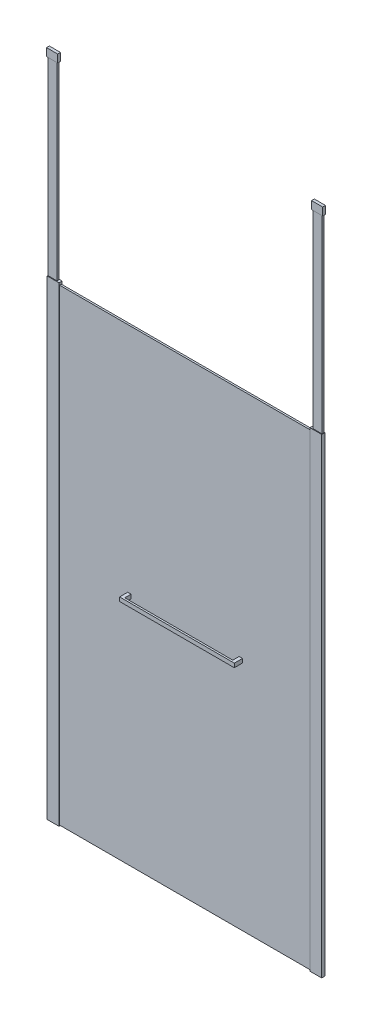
ISO-10303-21;
HEADER;
FILE_DESCRIPTION(('STEP AP214'),'2;1');
FILE_NAME('part.step','',(''),(''),'','','');
FILE_SCHEMA(('AUTOMOTIVE_DESIGN { 1 0 10303 214 1 1 1 1 }'));
ENDSEC;
DATA;
#1=APPLICATION_CONTEXT('core data for automotive mechanical design processes');
#2=APPLICATION_PROTOCOL_DEFINITION('international standard','automotive_design',2000,#1);
#3=PRODUCT_CONTEXT('',#1,'mechanical');
#4=PRODUCT('Part','Part','',(#3));
#5=PRODUCT_RELATED_PRODUCT_CATEGORY('part','',(#4));
#6=PRODUCT_DEFINITION_FORMATION('','',#4);
#7=PRODUCT_DEFINITION_CONTEXT('part definition',#1,'design');
#8=PRODUCT_DEFINITION('design','',#6,#7);
#9=PRODUCT_DEFINITION_SHAPE('','',#8);
#10=(LENGTH_UNIT() NAMED_UNIT(*) SI_UNIT(.MILLI.,.METRE.));
#11=(NAMED_UNIT(*) PLANE_ANGLE_UNIT() SI_UNIT($,.RADIAN.));
#12=(NAMED_UNIT(*) SI_UNIT($,.STERADIAN.) SOLID_ANGLE_UNIT());
#13=UNCERTAINTY_MEASURE_WITH_UNIT(LENGTH_MEASURE(1.E-05),#10,'distance_accuracy_value','');
#14=(GEOMETRIC_REPRESENTATION_CONTEXT(3) GLOBAL_UNCERTAINTY_ASSIGNED_CONTEXT((#13)) GLOBAL_UNIT_ASSIGNED_CONTEXT((#10,
#11,#12)) REPRESENTATION_CONTEXT('',''));
#15=CARTESIAN_POINT('',(0.,0.,0.));
#16=DIRECTION('',(0.,0.,1.));
#17=DIRECTION('',(1.,0.,0.));
#18=AXIS2_PLACEMENT_3D('',#15,#16,#17);
#19=CARTESIAN_POINT('',(373.9,1062.,-21.));
#20=DIRECTION('',(1.,0.,0.));
#21=DIRECTION('',(0.,0.,-1.));
#22=AXIS2_PLACEMENT_3D('',#19,#20,#21);
#23=PLANE('',#22);
#24=DIRECTION('',(0.,1.,0.));
#25=VECTOR('',#24,1.);
#26=CARTESIAN_POINT('',(373.9,1062.,25.5));
#27=LINE('',#26,#25);
#28=CARTESIAN_POINT('',(373.9,1044.,25.5));
#29=VERTEX_POINT('',#28);
#30=CARTESIAN_POINT('',(373.9,1062.,25.5));
#31=VERTEX_POINT('',#30);
#32=EDGE_CURVE('E63',#29,#31,#27,.T.);
#33=ORIENTED_EDGE('',*,*,#32,.F.);
#34=DIRECTION('',(0.,0.,1.));
#35=VECTOR('',#34,1.);
#36=CARTESIAN_POINT('',(373.9,1044.,-21.));
#37=LINE('',#36,#35);
#38=CARTESIAN_POINT('',(373.9,1044.,-21.));
#39=VERTEX_POINT('',#38);
#40=EDGE_CURVE('E12',#39,#29,#37,.T.);
#41=ORIENTED_EDGE('',*,*,#40,.F.);
#42=DIRECTION('',(0.,1.,0.));
#43=VECTOR('',#42,1.);
#44=CARTESIAN_POINT('',(373.9,1062.,-21.));
#45=LINE('',#44,#43);
#46=CARTESIAN_POINT('',(373.9,1062.,-21.));
#47=VERTEX_POINT('',#46);
#48=EDGE_CURVE('E193',#39,#47,#45,.T.);
#49=ORIENTED_EDGE('',*,*,#48,.T.);
#50=DIRECTION('',(0.,0.,1.));
#51=VECTOR('',#50,1.);
#52=CARTESIAN_POINT('',(373.9,1062.,-21.));
#53=LINE('',#52,#51);
#54=EDGE_CURVE('E176',#47,#31,#53,.T.);
#55=ORIENTED_EDGE('',*,*,#54,.T.);
#56=EDGE_LOOP('',(#33,#41,#49,#55));
#57=FACE_BOUND('',#56,.T.);
#58=ADVANCED_FACE('F46',(#57),#23,.T.);
#59=CARTESIAN_POINT('',(358.9,1044.,-21.));
#60=DIRECTION('',(0.,-1.,0.));
#61=DIRECTION('',(0.,0.,-1.));
#62=AXIS2_PLACEMENT_3D('',#59,#60,#61);
#63=PLANE('',#62);
#64=ORIENTED_EDGE('',*,*,#40,.T.);
#65=DIRECTION('',(-1.,0.,0.));
#66=VECTOR('',#65,1.);
#67=CARTESIAN_POINT('',(878.597715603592,1044.,25.5));
#68=LINE('',#67,#66);
#69=CARTESIAN_POINT('',(858.9,1044.,25.5));
#70=VERTEX_POINT('',#69);
#71=EDGE_CURVE('E166',#70,#29,#68,.T.);
#72=ORIENTED_EDGE('',*,*,#71,.F.);
#73=DIRECTION('',(0.,0.,1.));
#74=VECTOR('',#73,1.);
#75=CARTESIAN_POINT('',(858.9,1044.,-21.));
#76=LINE('',#75,#74);
#77=CARTESIAN_POINT('',(858.9,1044.,-21.));
#78=VERTEX_POINT('',#77);
#79=EDGE_CURVE('E149',#78,#70,#76,.T.);
#80=ORIENTED_EDGE('',*,*,#79,.F.);
#81=DIRECTION('',(1.,0.,0.));
#82=VECTOR('',#81,1.);
#83=CARTESIAN_POINT('',(858.9,1044.,-21.));
#84=LINE('',#83,#82);
#85=CARTESIAN_POINT('',(873.9,1044.,-21.));
#86=VERTEX_POINT('',#85);
#87=EDGE_CURVE('E131',#78,#86,#84,.T.);
#88=ORIENTED_EDGE('',*,*,#87,.T.);
#89=DIRECTION('',(0.,0.,1.));
#90=VECTOR('',#89,1.);
#91=CARTESIAN_POINT('',(873.9,1044.,-21.));
#92=LINE('',#91,#90);
#93=CARTESIAN_POINT('',(873.9,1044.,33.5));
#94=VERTEX_POINT('',#93);
#95=EDGE_CURVE('E147',#86,#94,#92,.T.);
#96=ORIENTED_EDGE('',*,*,#95,.T.);
#97=DIRECTION('',(1.,0.,0.));
#98=VECTOR('',#97,1.);
#99=CARTESIAN_POINT('',(358.9,1044.,33.5));
#100=LINE('',#99,#98);
#101=CARTESIAN_POINT('',(358.9,1044.,33.5));
#102=VERTEX_POINT('',#101);
#103=EDGE_CURVE('E135',#102,#94,#100,.T.);
#104=ORIENTED_EDGE('',*,*,#103,.F.);
#105=DIRECTION('',(0.,0.,1.));
#106=VECTOR('',#105,1.);
#107=CARTESIAN_POINT('',(358.9,1044.,-21.));
#108=LINE('',#107,#106);
#109=CARTESIAN_POINT('',(358.9,1044.,-21.));
#110=VERTEX_POINT('',#109);
#111=EDGE_CURVE('E55',#110,#102,#108,.T.);
#112=ORIENTED_EDGE('',*,*,#111,.F.);
#113=DIRECTION('',(1.,0.,0.));
#114=VECTOR('',#113,1.);
#115=CARTESIAN_POINT('',(358.9,1044.,-21.));
#116=LINE('',#115,#114);
#117=EDGE_CURVE('E181',#110,#39,#116,.T.);
#118=ORIENTED_EDGE('',*,*,#117,.T.);
#119=EDGE_LOOP('',(#64,#72,#80,#88,#96,#104,#112,#118));
#120=FACE_BOUND('',#119,.T.);
#121=ADVANCED_FACE('F197',(#120),#63,.T.);
#122=CARTESIAN_POINT('',(358.9,1062.,-21.));
#123=DIRECTION('',(-1.,0.,0.));
#124=DIRECTION('',(0.,0.,1.));
#125=AXIS2_PLACEMENT_3D('',#122,#123,#124);
#126=PLANE('',#125);
#127=ORIENTED_EDGE('',*,*,#111,.T.);
#128=DIRECTION('',(0.,-1.,0.));
#129=VECTOR('',#128,1.);
#130=CARTESIAN_POINT('',(358.9,1062.,33.5));
#131=LINE('',#130,#129);
#132=CARTESIAN_POINT('',(358.9,1062.,33.5));
#133=VERTEX_POINT('',#132);
#134=EDGE_CURVE('E121',#133,#102,#131,.T.);
#135=ORIENTED_EDGE('',*,*,#134,.F.);
#136=DIRECTION('',(0.,0.,1.));
#137=VECTOR('',#136,1.);
#138=CARTESIAN_POINT('',(358.9,1062.,-21.));
#139=LINE('',#138,#137);
#140=CARTESIAN_POINT('',(358.9,1062.,-21.));
#141=VERTEX_POINT('',#140);
#142=EDGE_CURVE('E116',#141,#133,#139,.T.);
#143=ORIENTED_EDGE('',*,*,#142,.F.);
#144=DIRECTION('',(0.,-1.,0.));
#145=VECTOR('',#144,1.);
#146=CARTESIAN_POINT('',(358.9,1062.,-21.));
#147=LINE('',#146,#145);
#148=EDGE_CURVE('E186',#141,#110,#147,.T.);
#149=ORIENTED_EDGE('',*,*,#148,.T.);
#150=EDGE_LOOP('',(#127,#135,#143,#149));
#151=FACE_BOUND('',#150,.T.);
#152=ADVANCED_FACE('F218',(#151),#126,.T.);
#153=CARTESIAN_POINT('',(358.9,1062.,-21.));
#154=DIRECTION('',(0.,1.,0.));
#155=DIRECTION('',(0.,0.,1.));
#156=AXIS2_PLACEMENT_3D('',#153,#154,#155);
#157=PLANE('',#156);
#158=ORIENTED_EDGE('',*,*,#142,.T.);
#159=DIRECTION('',(-1.,0.,0.));
#160=VECTOR('',#159,1.);
#161=CARTESIAN_POINT('',(358.9,1062.,33.5));
#162=LINE('',#161,#160);
#163=CARTESIAN_POINT('',(873.9,1062.,33.5));
#164=VERTEX_POINT('',#163);
#165=EDGE_CURVE('E109',#164,#133,#162,.T.);
#166=ORIENTED_EDGE('',*,*,#165,.F.);
#167=DIRECTION('',(0.,0.,1.));
#168=VECTOR('',#167,1.);
#169=CARTESIAN_POINT('',(873.9,1062.,-21.));
#170=LINE('',#169,#168);
#171=CARTESIAN_POINT('',(873.9,1062.,-21.));
#172=VERTEX_POINT('',#171);
#173=EDGE_CURVE('E113',#172,#164,#170,.T.);
#174=ORIENTED_EDGE('',*,*,#173,.F.);
#175=DIRECTION('',(-1.,0.,0.));
#176=VECTOR('',#175,1.);
#177=CARTESIAN_POINT('',(858.9,1062.,-21.));
#178=LINE('',#177,#176);
#179=CARTESIAN_POINT('',(858.9,1062.,-21.));
#180=VERTEX_POINT('',#179);
#181=EDGE_CURVE('E138',#172,#180,#178,.T.);
#182=ORIENTED_EDGE('',*,*,#181,.T.);
#183=DIRECTION('',(0.,0.,1.));
#184=VECTOR('',#183,1.);
#185=CARTESIAN_POINT('',(858.9,1062.,-21.));
#186=LINE('',#185,#184);
#187=CARTESIAN_POINT('',(858.9,1062.,25.5));
#188=VERTEX_POINT('',#187);
#189=EDGE_CURVE('E130',#180,#188,#186,.T.);
#190=ORIENTED_EDGE('',*,*,#189,.T.);
#191=DIRECTION('',(-1.,0.,0.));
#192=VECTOR('',#191,1.);
#193=CARTESIAN_POINT('',(878.597715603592,1062.,25.5));
#194=LINE('',#193,#192);
#195=EDGE_CURVE('E163',#188,#31,#194,.T.);
#196=ORIENTED_EDGE('',*,*,#195,.T.);
#197=ORIENTED_EDGE('',*,*,#54,.F.);
#198=DIRECTION('',(-1.,0.,0.));
#199=VECTOR('',#198,1.);
#200=CARTESIAN_POINT('',(358.9,1062.,-21.));
#201=LINE('',#200,#199);
#202=EDGE_CURVE('E190',#47,#141,#201,.T.);
#203=ORIENTED_EDGE('',*,*,#202,.T.);
#204=EDGE_LOOP('',(#158,#166,#174,#182,#190,#196,#197,#203));
#205=FACE_BOUND('',#204,.T.);
#206=ADVANCED_FACE('F111',(#205),#157,.T.);
#207=CARTESIAN_POINT('',(373.9,1044.,-21.));
#208=DIRECTION('',(0.,0.,1.));
#209=DIRECTION('',(1.,0.,0.));
#210=AXIS2_PLACEMENT_3D('',#207,#208,#209);
#211=PLANE('',#210);
#212=ORIENTED_EDGE('',*,*,#48,.F.);
#213=ORIENTED_EDGE('',*,*,#117,.F.);
#214=ORIENTED_EDGE('',*,*,#148,.F.);
#215=ORIENTED_EDGE('',*,*,#202,.F.);
#216=EDGE_LOOP('',(#212,#213,#214,#215));
#217=FACE_BOUND('',#216,.T.);
#218=ADVANCED_FACE('F225',(#217),#211,.F.);
#219=CARTESIAN_POINT('',(373.9,1044.,33.5));
#220=DIRECTION('',(0.,0.,1.));
#221=DIRECTION('',(1.,0.,0.));
#222=AXIS2_PLACEMENT_3D('',#219,#220,#221);
#223=PLANE('',#222);
#224=ORIENTED_EDGE('',*,*,#103,.T.);
#225=DIRECTION('',(0.,1.,0.));
#226=VECTOR('',#225,1.);
#227=CARTESIAN_POINT('',(873.9,1062.,33.5));
#228=LINE('',#227,#226);
#229=EDGE_CURVE('E127',#94,#164,#228,.T.);
#230=ORIENTED_EDGE('',*,*,#229,.T.);
#231=ORIENTED_EDGE('',*,*,#165,.T.);
#232=ORIENTED_EDGE('',*,*,#134,.T.);
#233=EDGE_LOOP('',(#224,#230,#231,#232));
#234=FACE_BOUND('',#233,.T.);
#235=ADVANCED_FACE('F133',(#234),#223,.T.);
#236=CARTESIAN_POINT('',(878.597715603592,1062.,25.5));
#237=DIRECTION('',(0.,0.,1.));
#238=DIRECTION('',(0.,-1.,0.));
#239=AXIS2_PLACEMENT_3D('',#236,#237,#238);
#240=PLANE('',#239);
#241=ORIENTED_EDGE('',*,*,#195,.F.);
#242=DIRECTION('',(0.,-1.,0.));
#243=VECTOR('',#242,1.);
#244=CARTESIAN_POINT('',(858.9,1062.,25.5));
#245=LINE('',#244,#243);
#246=EDGE_CURVE('E49',#188,#70,#245,.T.);
#247=ORIENTED_EDGE('',*,*,#246,.T.);
#248=ORIENTED_EDGE('',*,*,#71,.T.);
#249=ORIENTED_EDGE('',*,*,#32,.T.);
#250=EDGE_LOOP('',(#241,#247,#248,#249));
#251=FACE_BOUND('',#250,.T.);
#252=ADVANCED_FACE('F203',(#251),#240,.F.);
#253=CARTESIAN_POINT('',(858.9,1062.,-21.));
#254=DIRECTION('',(-1.,0.,0.));
#255=DIRECTION('',(0.,0.,1.));
#256=AXIS2_PLACEMENT_3D('',#253,#254,#255);
#257=PLANE('',#256);
#258=ORIENTED_EDGE('',*,*,#246,.F.);
#259=ORIENTED_EDGE('',*,*,#189,.F.);
#260=DIRECTION('',(0.,-1.,0.));
#261=VECTOR('',#260,1.);
#262=CARTESIAN_POINT('',(858.9,1062.,-21.));
#263=LINE('',#262,#261);
#264=EDGE_CURVE('E142',#180,#78,#263,.T.);
#265=ORIENTED_EDGE('',*,*,#264,.T.);
#266=ORIENTED_EDGE('',*,*,#79,.T.);
#267=EDGE_LOOP('',(#258,#259,#265,#266));
#268=FACE_BOUND('',#267,.T.);
#269=ADVANCED_FACE('F204',(#268),#257,.T.);
#270=CARTESIAN_POINT('',(873.9,1062.,-21.));
#271=DIRECTION('',(1.,0.,0.));
#272=DIRECTION('',(0.,0.,-1.));
#273=AXIS2_PLACEMENT_3D('',#270,#271,#272);
#274=PLANE('',#273);
#275=ORIENTED_EDGE('',*,*,#173,.T.);
#276=ORIENTED_EDGE('',*,*,#229,.F.);
#277=ORIENTED_EDGE('',*,*,#95,.F.);
#278=DIRECTION('',(0.,1.,0.));
#279=VECTOR('',#278,1.);
#280=CARTESIAN_POINT('',(873.9,1062.,-21.));
#281=LINE('',#280,#279);
#282=EDGE_CURVE('E129',#86,#172,#281,.T.);
#283=ORIENTED_EDGE('',*,*,#282,.T.);
#284=EDGE_LOOP('',(#275,#276,#277,#283));
#285=FACE_BOUND('',#284,.T.);
#286=ADVANCED_FACE('F126',(#285),#274,.T.);
#287=CARTESIAN_POINT('',(873.9,1044.,-21.));
#288=DIRECTION('',(0.,0.,1.));
#289=DIRECTION('',(1.,0.,0.));
#290=AXIS2_PLACEMENT_3D('',#287,#288,#289);
#291=PLANE('',#290);
#292=ORIENTED_EDGE('',*,*,#282,.F.);
#293=ORIENTED_EDGE('',*,*,#87,.F.);
#294=ORIENTED_EDGE('',*,*,#264,.F.);
#295=ORIENTED_EDGE('',*,*,#181,.F.);
#296=EDGE_LOOP('',(#292,#293,#294,#295));
#297=FACE_BOUND('',#296,.T.);
#298=ADVANCED_FACE('F200',(#297),#291,.F.);
#299=CLOSED_SHELL('',(#58,#121,#152,#206,#218,#235,#252,#269,#286,#298));
#300=MANIFOLD_SOLID_BREP('B2',#299);
#301=CARTESIAN_POINT('',(46.5,3000.,-13.2499999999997));
#302=DIRECTION('',(-1.,0.,0.));
#303=DIRECTION('',(0.,-1.,0.));
#304=AXIS2_PLACEMENT_3D('',#301,#302,#303);
#305=PLANE('',#304);
#306=DIRECTION('',(0.,0.,-1.));
#307=VECTOR('',#306,1.);
#308=CARTESIAN_POINT('',(46.5,2965.,-13.2499999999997));
#309=LINE('',#308,#307);
#310=CARTESIAN_POINT('',(46.5,2965.,-0.749999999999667));
#311=VERTEX_POINT('',#310);
#312=CARTESIAN_POINT('',(46.5,2965.,-13.2499999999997));
#313=VERTEX_POINT('',#312);
#314=EDGE_CURVE('E381',#311,#313,#309,.T.);
#315=ORIENTED_EDGE('',*,*,#314,.T.);
#316=DIRECTION('',(0.,-1.,0.));
#317=VECTOR('',#316,1.);
#318=CARTESIAN_POINT('',(46.5,3000.,-13.2499999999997));
#319=LINE('',#318,#317);
#320=CARTESIAN_POINT('',(46.5,3000.,-13.2499999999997));
#321=VERTEX_POINT('',#320);
#322=EDGE_CURVE('E44',#321,#313,#319,.T.);
#323=ORIENTED_EDGE('',*,*,#322,.F.);
#324=DIRECTION('',(0.,0.,-1.));
#325=VECTOR('',#324,1.);
#326=CARTESIAN_POINT('',(46.5,3000.,-13.2499999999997));
#327=LINE('',#326,#325);
#328=CARTESIAN_POINT('',(46.5,3000.,-0.74999999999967));
#329=VERTEX_POINT('',#328);
#330=EDGE_CURVE('E369',#329,#321,#327,.T.);
#331=ORIENTED_EDGE('',*,*,#330,.F.);
#332=DIRECTION('',(0.,-1.,0.));
#333=VECTOR('',#332,1.);
#334=CARTESIAN_POINT('',(46.5,3000.,-0.74999999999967));
#335=LINE('',#334,#333);
#336=EDGE_CURVE('E377',#329,#311,#335,.T.);
#337=ORIENTED_EDGE('',*,*,#336,.T.);
#338=EDGE_LOOP('',(#315,#323,#331,#337));
#339=FACE_BOUND('',#338,.T.);
#340=ADVANCED_FACE('F318',(#339),#305,.F.);
#341=CARTESIAN_POINT('',(-3.5,3000.,-13.2499999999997));
#342=DIRECTION('',(0.,0.,1.));
#343=DIRECTION('',(0.,-1.,0.));
#344=AXIS2_PLACEMENT_3D('',#341,#342,#343);
#345=PLANE('',#344);
#346=DIRECTION('',(-1.,0.,0.));
#347=VECTOR('',#346,1.);
#348=CARTESIAN_POINT('',(-3.5,2965.,-13.2499999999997));
#349=LINE('',#348,#347);
#350=CARTESIAN_POINT('',(-3.5,2965.,-13.2499999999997));
#351=VERTEX_POINT('',#350);
#352=EDGE_CURVE('E373',#313,#351,#349,.T.);
#353=ORIENTED_EDGE('',*,*,#352,.T.);
#354=DIRECTION('',(0.,-1.,0.));
#355=VECTOR('',#354,1.);
#356=CARTESIAN_POINT('',(-3.5,3000.,-13.2499999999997));
#357=LINE('',#356,#355);
#358=CARTESIAN_POINT('',(-3.5,3000.,-13.2499999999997));
#359=VERTEX_POINT('',#358);
#360=EDGE_CURVE('E326',#359,#351,#357,.T.);
#361=ORIENTED_EDGE('',*,*,#360,.F.);
#362=DIRECTION('',(-1.,0.,0.));
#363=VECTOR('',#362,1.);
#364=CARTESIAN_POINT('',(-3.5,3000.,-13.2499999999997));
#365=LINE('',#364,#363);
#366=EDGE_CURVE('E364',#321,#359,#365,.T.);
#367=ORIENTED_EDGE('',*,*,#366,.F.);
#368=ORIENTED_EDGE('',*,*,#322,.T.);
#369=EDGE_LOOP('',(#353,#361,#367,#368));
#370=FACE_BOUND('',#369,.T.);
#371=ADVANCED_FACE('F372',(#370),#345,.F.);
#372=CARTESIAN_POINT('',(-3.5,3000.,-13.2499999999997));
#373=DIRECTION('',(1.,0.,0.));
#374=DIRECTION('',(0.,0.,-1.));
#375=AXIS2_PLACEMENT_3D('',#372,#373,#374);
#376=PLANE('',#375);
#377=DIRECTION('',(0.,0.,1.));
#378=VECTOR('',#377,1.);
#379=CARTESIAN_POINT('',(-3.5,2965.,-13.2499999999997));
#380=LINE('',#379,#378);
#381=CARTESIAN_POINT('',(-3.5,2965.,-0.749999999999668));
#382=VERTEX_POINT('',#381);
#383=EDGE_CURVE('E351',#351,#382,#380,.T.);
#384=ORIENTED_EDGE('',*,*,#383,.T.);
#385=DIRECTION('',(0.,-1.,0.));
#386=VECTOR('',#385,1.);
#387=CARTESIAN_POINT('',(-3.5,3000.,-0.74999999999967));
#388=LINE('',#387,#386);
#389=CARTESIAN_POINT('',(-3.5,3000.,-0.74999999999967));
#390=VERTEX_POINT('',#389);
#391=EDGE_CURVE('E374',#390,#382,#388,.T.);
#392=ORIENTED_EDGE('',*,*,#391,.F.);
#393=DIRECTION('',(0.,0.,1.));
#394=VECTOR('',#393,1.);
#395=CARTESIAN_POINT('',(-3.5,3000.,-13.2499999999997));
#396=LINE('',#395,#394);
#397=EDGE_CURVE('E367',#359,#390,#396,.T.);
#398=ORIENTED_EDGE('',*,*,#397,.F.);
#399=ORIENTED_EDGE('',*,*,#360,.T.);
#400=EDGE_LOOP('',(#384,#392,#398,#399));
#401=FACE_BOUND('',#400,.T.);
#402=ADVANCED_FACE('F375',(#401),#376,.F.);
#403=CARTESIAN_POINT('',(-3.5,3000.,-0.74999999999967));
#404=DIRECTION('',(0.,0.,-1.));
#405=DIRECTION('',(0.,1.,0.));
#406=AXIS2_PLACEMENT_3D('',#403,#404,#405);
#407=PLANE('',#406);
#408=DIRECTION('',(1.,0.,0.));
#409=VECTOR('',#408,1.);
#410=CARTESIAN_POINT('',(-3.5,2965.,-0.749999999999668));
#411=LINE('',#410,#409);
#412=EDGE_CURVE('E357',#382,#311,#411,.T.);
#413=ORIENTED_EDGE('',*,*,#412,.T.);
#414=ORIENTED_EDGE('',*,*,#336,.F.);
#415=DIRECTION('',(1.,0.,0.));
#416=VECTOR('',#415,1.);
#417=CARTESIAN_POINT('',(-3.5,3000.,-0.74999999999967));
#418=LINE('',#417,#416);
#419=EDGE_CURVE('E334',#390,#329,#418,.T.);
#420=ORIENTED_EDGE('',*,*,#419,.F.);
#421=ORIENTED_EDGE('',*,*,#391,.T.);
#422=EDGE_LOOP('',(#413,#414,#420,#421));
#423=FACE_BOUND('',#422,.T.);
#424=ADVANCED_FACE('F388',(#423),#407,.F.);
#425=CARTESIAN_POINT('',(46.5,3000.,-0.74999999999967));
#426=DIRECTION('',(0.,1.,0.));
#427=DIRECTION('',(0.,0.,1.));
#428=AXIS2_PLACEMENT_3D('',#425,#426,#427);
#429=PLANE('',#428);
#430=ORIENTED_EDGE('',*,*,#330,.T.);
#431=ORIENTED_EDGE('',*,*,#366,.T.);
#432=ORIENTED_EDGE('',*,*,#397,.T.);
#433=ORIENTED_EDGE('',*,*,#419,.T.);
#434=EDGE_LOOP('',(#430,#431,#432,#433));
#435=FACE_BOUND('',#434,.T.);
#436=ADVANCED_FACE('F365',(#435),#429,.T.);
#437=CARTESIAN_POINT('',(46.5,2965.,-0.749999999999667));
#438=DIRECTION('',(0.,1.,0.));
#439=DIRECTION('',(0.,0.,1.));
#440=AXIS2_PLACEMENT_3D('',#437,#438,#439);
#441=PLANE('',#440);
#442=ORIENTED_EDGE('',*,*,#314,.F.);
#443=ORIENTED_EDGE('',*,*,#412,.F.);
#444=ORIENTED_EDGE('',*,*,#383,.F.);
#445=ORIENTED_EDGE('',*,*,#352,.F.);
#446=EDGE_LOOP('',(#442,#443,#444,#445));
#447=FACE_BOUND('',#446,.T.);
#448=ADVANCED_FACE('F391',(#447),#441,.F.);
#449=CLOSED_SHELL('',(#340,#371,#402,#424,#436,#448));
#450=MANIFOLD_SOLID_BREP('B6',#449);
#451=CARTESIAN_POINT('',(1.5,2997.,-2.99999999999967));
#452=DIRECTION('',(-1.,0.,0.));
#453=DIRECTION('',(0.,0.,1.));
#454=AXIS2_PLACEMENT_3D('',#451,#452,#453);
#455=PLANE('',#454);
#456=DIRECTION('',(0.,0.,-1.));
#457=VECTOR('',#456,1.);
#458=CARTESIAN_POINT('',(1.5,2114.,-2.99999999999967));
#459=LINE('',#458,#457);
#460=CARTESIAN_POINT('',(1.5,2114.,-2.99999999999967));
#461=VERTEX_POINT('',#460);
#462=CARTESIAN_POINT('',(1.5,2114.,-10.9999999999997));
#463=VERTEX_POINT('',#462);
#464=EDGE_CURVE('E516',#461,#463,#459,.T.);
#465=ORIENTED_EDGE('',*,*,#464,.F.);
#466=DIRECTION('',(0.,-1.,0.));
#467=VECTOR('',#466,1.);
#468=CARTESIAN_POINT('',(1.5,2997.,-2.99999999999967));
#469=LINE('',#468,#467);
#470=CARTESIAN_POINT('',(1.5,2997.,-2.99999999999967));
#471=VERTEX_POINT('',#470);
#472=EDGE_CURVE('E316',#471,#461,#469,.T.);
#473=ORIENTED_EDGE('',*,*,#472,.F.);
#474=DIRECTION('',(0.,0.,-1.));
#475=VECTOR('',#474,1.);
#476=CARTESIAN_POINT('',(1.5,2997.,-2.99999999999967));
#477=LINE('',#476,#475);
#478=CARTESIAN_POINT('',(1.5,2997.,-10.9999999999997));
#479=VERTEX_POINT('',#478);
#480=EDGE_CURVE('E510',#471,#479,#477,.T.);
#481=ORIENTED_EDGE('',*,*,#480,.T.);
#482=DIRECTION('',(0.,-1.,0.));
#483=VECTOR('',#482,1.);
#484=CARTESIAN_POINT('',(1.5,2997.,-10.9999999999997));
#485=LINE('',#484,#483);
#486=EDGE_CURVE('E455',#479,#463,#485,.T.);
#487=ORIENTED_EDGE('',*,*,#486,.T.);
#488=EDGE_LOOP('',(#465,#473,#481,#487));
#489=FACE_BOUND('',#488,.T.);
#490=ADVANCED_FACE('F452',(#489),#455,.T.);
#491=CARTESIAN_POINT('',(1.5,2997.,-2.99999999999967));
#492=DIRECTION('',(0.,0.,1.));
#493=DIRECTION('',(1.,0.,0.));
#494=AXIS2_PLACEMENT_3D('',#491,#492,#493);
#495=PLANE('',#494);
#496=DIRECTION('',(-1.,0.,0.));
#497=VECTOR('',#496,1.);
#498=CARTESIAN_POINT('',(1.5,2114.,-2.99999999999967));
#499=LINE('',#498,#497);
#500=CARTESIAN_POINT('',(41.5,2114.,-2.99999999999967));
#501=VERTEX_POINT('',#500);
#502=EDGE_CURVE('E512',#501,#461,#499,.T.);
#503=ORIENTED_EDGE('',*,*,#502,.F.);
#504=DIRECTION('',(0.,-1.,0.));
#505=VECTOR('',#504,1.);
#506=CARTESIAN_POINT('',(41.5,2997.,-2.99999999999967));
#507=LINE('',#506,#505);
#508=CARTESIAN_POINT('',(41.5,2997.,-2.99999999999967));
#509=VERTEX_POINT('',#508);
#510=EDGE_CURVE('E461',#509,#501,#507,.T.);
#511=ORIENTED_EDGE('',*,*,#510,.F.);
#512=DIRECTION('',(-1.,0.,0.));
#513=VECTOR('',#512,1.);
#514=CARTESIAN_POINT('',(1.5,2997.,-2.99999999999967));
#515=LINE('',#514,#513);
#516=EDGE_CURVE('E507',#509,#471,#515,.T.);
#517=ORIENTED_EDGE('',*,*,#516,.T.);
#518=ORIENTED_EDGE('',*,*,#472,.T.);
#519=EDGE_LOOP('',(#503,#511,#517,#518));
#520=FACE_BOUND('',#519,.T.);
#521=ADVANCED_FACE('F526',(#520),#495,.T.);
#522=CARTESIAN_POINT('',(41.5,2997.,-2.99999999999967));
#523=DIRECTION('',(1.,0.,0.));
#524=DIRECTION('',(0.,0.,-1.));
#525=AXIS2_PLACEMENT_3D('',#522,#523,#524);
#526=PLANE('',#525);
#527=DIRECTION('',(0.,0.,1.));
#528=VECTOR('',#527,1.);
#529=CARTESIAN_POINT('',(41.5,2114.,-2.99999999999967));
#530=LINE('',#529,#528);
#531=CARTESIAN_POINT('',(41.5,2114.,-10.9999999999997));
#532=VERTEX_POINT('',#531);
#533=EDGE_CURVE('E502',#532,#501,#530,.T.);
#534=ORIENTED_EDGE('',*,*,#533,.F.);
#535=DIRECTION('',(0.,-1.,0.));
#536=VECTOR('',#535,1.);
#537=CARTESIAN_POINT('',(41.5,2997.,-10.9999999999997));
#538=LINE('',#537,#536);
#539=CARTESIAN_POINT('',(41.5,2997.,-10.9999999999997));
#540=VERTEX_POINT('',#539);
#541=EDGE_CURVE('E497',#540,#532,#538,.T.);
#542=ORIENTED_EDGE('',*,*,#541,.F.);
#543=DIRECTION('',(0.,0.,1.));
#544=VECTOR('',#543,1.);
#545=CARTESIAN_POINT('',(41.5,2997.,-2.99999999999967));
#546=LINE('',#545,#544);
#547=EDGE_CURVE('E500',#540,#509,#546,.T.);
#548=ORIENTED_EDGE('',*,*,#547,.T.);
#549=ORIENTED_EDGE('',*,*,#510,.T.);
#550=EDGE_LOOP('',(#534,#542,#548,#549));
#551=FACE_BOUND('',#550,.T.);
#552=ADVANCED_FACE('F499',(#551),#526,.T.);
#553=CARTESIAN_POINT('',(1.5,2997.,-10.9999999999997));
#554=DIRECTION('',(0.,0.,-1.));
#555=DIRECTION('',(-1.,0.,0.));
#556=AXIS2_PLACEMENT_3D('',#553,#554,#555);
#557=PLANE('',#556);
#558=DIRECTION('',(1.,0.,0.));
#559=VECTOR('',#558,1.);
#560=CARTESIAN_POINT('',(1.5,2114.,-10.9999999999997));
#561=LINE('',#560,#559);
#562=EDGE_CURVE('E519',#463,#532,#561,.T.);
#563=ORIENTED_EDGE('',*,*,#562,.F.);
#564=ORIENTED_EDGE('',*,*,#486,.F.);
#565=DIRECTION('',(1.,0.,0.));
#566=VECTOR('',#565,1.);
#567=CARTESIAN_POINT('',(1.5,2997.,-10.9999999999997));
#568=LINE('',#567,#566);
#569=EDGE_CURVE('E506',#479,#540,#568,.T.);
#570=ORIENTED_EDGE('',*,*,#569,.T.);
#571=ORIENTED_EDGE('',*,*,#541,.T.);
#572=EDGE_LOOP('',(#563,#564,#570,#571));
#573=FACE_BOUND('',#572,.T.);
#574=ADVANCED_FACE('F509',(#573),#557,.T.);
#575=CARTESIAN_POINT('',(1.5,2997.,-10.9999999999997));
#576=DIRECTION('',(0.,-1.,0.));
#577=DIRECTION('',(0.,0.,-1.));
#578=AXIS2_PLACEMENT_3D('',#575,#576,#577);
#579=PLANE('',#578);
#580=ORIENTED_EDGE('',*,*,#480,.F.);
#581=ORIENTED_EDGE('',*,*,#516,.F.);
#582=ORIENTED_EDGE('',*,*,#547,.F.);
#583=ORIENTED_EDGE('',*,*,#569,.F.);
#584=EDGE_LOOP('',(#580,#581,#582,#583));
#585=FACE_BOUND('',#584,.T.);
#586=ADVANCED_FACE('F505',(#585),#579,.F.);
#587=CARTESIAN_POINT('',(1.5,2114.,-10.9999999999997));
#588=DIRECTION('',(0.,-1.,0.));
#589=DIRECTION('',(0.,0.,-1.));
#590=AXIS2_PLACEMENT_3D('',#587,#588,#589);
#591=PLANE('',#590);
#592=ORIENTED_EDGE('',*,*,#464,.T.);
#593=ORIENTED_EDGE('',*,*,#562,.T.);
#594=ORIENTED_EDGE('',*,*,#533,.T.);
#595=ORIENTED_EDGE('',*,*,#502,.T.);
#596=EDGE_LOOP('',(#592,#593,#594,#595));
#597=FACE_BOUND('',#596,.T.);
#598=ADVANCED_FACE('F525',(#597),#591,.T.);
#599=CLOSED_SHELL('',(#490,#521,#552,#574,#586,#598));
#600=MANIFOLD_SOLID_BREP('B38',#599);
#601=CARTESIAN_POINT('',(1186.3,3000.,-0.749999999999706));
#602=DIRECTION('',(1.,0.,0.));
#603=DIRECTION('',(0.,1.,0.));
#604=AXIS2_PLACEMENT_3D('',#601,#602,#603);
#605=PLANE('',#604);
#606=DIRECTION('',(0.,0.,1.));
#607=VECTOR('',#606,1.);
#608=CARTESIAN_POINT('',(1186.3,2965.,-0.749999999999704));
#609=LINE('',#608,#607);
#610=CARTESIAN_POINT('',(1186.3,2965.,-13.2499999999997));
#611=VERTEX_POINT('',#610);
#612=CARTESIAN_POINT('',(1186.3,2965.,-0.749999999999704));
#613=VERTEX_POINT('',#612);
#614=EDGE_CURVE('E674',#611,#613,#609,.T.);
#615=ORIENTED_EDGE('',*,*,#614,.T.);
#616=DIRECTION('',(0.,-1.,0.));
#617=VECTOR('',#616,1.);
#618=CARTESIAN_POINT('',(1186.3,3000.,-0.749999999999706));
#619=LINE('',#618,#617);
#620=CARTESIAN_POINT('',(1186.3,3000.,-0.749999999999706));
#621=VERTEX_POINT('',#620);
#622=EDGE_CURVE('E655',#621,#613,#619,.T.);
#623=ORIENTED_EDGE('',*,*,#622,.F.);
#624=DIRECTION('',(0.,0.,1.));
#625=VECTOR('',#624,1.);
#626=CARTESIAN_POINT('',(1186.3,3000.,-0.749999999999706));
#627=LINE('',#626,#625);
#628=CARTESIAN_POINT('',(1186.3,3000.,-13.2499999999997));
#629=VERTEX_POINT('',#628);
#630=EDGE_CURVE('E662',#629,#621,#627,.T.);
#631=ORIENTED_EDGE('',*,*,#630,.F.);
#632=DIRECTION('',(0.,-1.,0.));
#633=VECTOR('',#632,1.);
#634=CARTESIAN_POINT('',(1186.3,3000.,-13.2499999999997));
#635=LINE('',#634,#633);
#636=EDGE_CURVE('E813',#629,#611,#635,.T.);
#637=ORIENTED_EDGE('',*,*,#636,.T.);
#638=EDGE_LOOP('',(#615,#623,#631,#637));
#639=FACE_BOUND('',#638,.T.);
#640=ADVANCED_FACE('F586',(#639),#605,.F.);
#641=CARTESIAN_POINT('',(1236.3,3000.,-0.749999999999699));
#642=DIRECTION('',(0.,0.,-1.));
#643=DIRECTION('',(-1.,0.,0.));
#644=AXIS2_PLACEMENT_3D('',#641,#642,#643);
#645=PLANE('',#644);
#646=DIRECTION('',(1.,0.,0.));
#647=VECTOR('',#646,1.);
#648=CARTESIAN_POINT('',(1236.3,2965.,-0.749999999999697));
#649=LINE('',#648,#647);
#650=CARTESIAN_POINT('',(1236.3,2965.,-0.749999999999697));
#651=VERTEX_POINT('',#650);
#652=EDGE_CURVE('E811',#613,#651,#649,.T.);
#653=ORIENTED_EDGE('',*,*,#652,.T.);
#654=DIRECTION('',(0.,-1.,0.));
#655=VECTOR('',#654,1.);
#656=CARTESIAN_POINT('',(1236.3,3000.,-0.749999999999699));
#657=LINE('',#656,#655);
#658=CARTESIAN_POINT('',(1236.3,3000.,-0.749999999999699));
#659=VERTEX_POINT('',#658);
#660=EDGE_CURVE('E658',#659,#651,#657,.T.);
#661=ORIENTED_EDGE('',*,*,#660,.F.);
#662=DIRECTION('',(1.,0.,0.));
#663=VECTOR('',#662,1.);
#664=CARTESIAN_POINT('',(1236.3,3000.,-0.749999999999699));
#665=LINE('',#664,#663);
#666=EDGE_CURVE('E651',#621,#659,#665,.T.);
#667=ORIENTED_EDGE('',*,*,#666,.F.);
#668=ORIENTED_EDGE('',*,*,#622,.T.);
#669=EDGE_LOOP('',(#653,#661,#667,#668));
#670=FACE_BOUND('',#669,.T.);
#671=ADVANCED_FACE('F653',(#670),#645,.F.);
#672=CARTESIAN_POINT('',(1236.3,3000.,-0.749999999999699));
#673=DIRECTION('',(-1.,0.,0.));
#674=DIRECTION('',(0.,-1.,0.));
#675=AXIS2_PLACEMENT_3D('',#672,#673,#674);
#676=PLANE('',#675);
#677=DIRECTION('',(0.,0.,-1.));
#678=VECTOR('',#677,1.);
#679=CARTESIAN_POINT('',(1236.3,2965.,-0.749999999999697));
#680=LINE('',#679,#678);
#681=CARTESIAN_POINT('',(1236.3,2965.,-13.2499999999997));
#682=VERTEX_POINT('',#681);
#683=EDGE_CURVE('E807',#651,#682,#680,.T.);
#684=ORIENTED_EDGE('',*,*,#683,.T.);
#685=DIRECTION('',(0.,-1.,0.));
#686=VECTOR('',#685,1.);
#687=CARTESIAN_POINT('',(1236.3,3000.,-13.2499999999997));
#688=LINE('',#687,#686);
#689=CARTESIAN_POINT('',(1236.3,3000.,-13.2499999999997));
#690=VERTEX_POINT('',#689);
#691=EDGE_CURVE('E678',#690,#682,#688,.T.);
#692=ORIENTED_EDGE('',*,*,#691,.F.);
#693=DIRECTION('',(0.,0.,-1.));
#694=VECTOR('',#693,1.);
#695=CARTESIAN_POINT('',(1236.3,3000.,-0.749999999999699));
#696=LINE('',#695,#694);
#697=EDGE_CURVE('E661',#659,#690,#696,.T.);
#698=ORIENTED_EDGE('',*,*,#697,.F.);
#699=ORIENTED_EDGE('',*,*,#660,.T.);
#700=EDGE_LOOP('',(#684,#692,#698,#699));
#701=FACE_BOUND('',#700,.T.);
#702=ADVANCED_FACE('F728',(#701),#676,.F.);
#703=CARTESIAN_POINT('',(1236.3,3000.,-13.2499999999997));
#704=DIRECTION('',(0.,0.,1.));
#705=DIRECTION('',(1.,0.,0.));
#706=AXIS2_PLACEMENT_3D('',#703,#704,#705);
#707=PLANE('',#706);
#708=DIRECTION('',(-1.,0.,0.));
#709=VECTOR('',#708,1.);
#710=CARTESIAN_POINT('',(1236.3,2965.,-13.2499999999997));
#711=LINE('',#710,#709);
#712=EDGE_CURVE('E671',#682,#611,#711,.T.);
#713=ORIENTED_EDGE('',*,*,#712,.T.);
#714=ORIENTED_EDGE('',*,*,#636,.F.);
#715=DIRECTION('',(-1.,0.,0.));
#716=VECTOR('',#715,1.);
#717=CARTESIAN_POINT('',(1236.3,3000.,-13.2499999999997));
#718=LINE('',#717,#716);
#719=EDGE_CURVE('E667',#690,#629,#718,.T.);
#720=ORIENTED_EDGE('',*,*,#719,.F.);
#721=ORIENTED_EDGE('',*,*,#691,.T.);
#722=EDGE_LOOP('',(#713,#714,#720,#721));
#723=FACE_BOUND('',#722,.T.);
#724=ADVANCED_FACE('F775',(#723),#707,.F.);
#725=CARTESIAN_POINT('',(1186.3,3000.,-13.2499999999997));
#726=DIRECTION('',(0.,1.,0.));
#727=DIRECTION('',(0.,0.,1.));
#728=AXIS2_PLACEMENT_3D('',#725,#726,#727);
#729=PLANE('',#728);
#730=ORIENTED_EDGE('',*,*,#630,.T.);
#731=ORIENTED_EDGE('',*,*,#666,.T.);
#732=ORIENTED_EDGE('',*,*,#697,.T.);
#733=ORIENTED_EDGE('',*,*,#719,.T.);
#734=EDGE_LOOP('',(#730,#731,#732,#733));
#735=FACE_BOUND('',#734,.T.);
#736=ADVANCED_FACE('F665',(#735),#729,.T.);
#737=CARTESIAN_POINT('',(1186.3,2965.,-13.2499999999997));
#738=DIRECTION('',(0.,1.,0.));
#739=DIRECTION('',(0.,0.,1.));
#740=AXIS2_PLACEMENT_3D('',#737,#738,#739);
#741=PLANE('',#740);
#742=DIRECTION('',(0.,0.,1.));
#743=VECTOR('',#742,1.);
#744=CARTESIAN_POINT('',(1231.3,2965.,-10.9999999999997));
#745=LINE('',#744,#743);
#746=CARTESIAN_POINT('',(1231.3,2965.,-10.9999999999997));
#747=VERTEX_POINT('',#746);
#748=CARTESIAN_POINT('',(1231.3,2965.,-2.99999999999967));
#749=VERTEX_POINT('',#748);
#750=EDGE_CURVE('E683',#747,#749,#745,.T.);
#751=ORIENTED_EDGE('',*,*,#750,.F.);
#752=DIRECTION('',(1.,0.,0.));
#753=VECTOR('',#752,1.);
#754=CARTESIAN_POINT('',(1231.3,2965.,-10.9999999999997));
#755=LINE('',#754,#753);
#756=CARTESIAN_POINT('',(1191.3,2965.,-10.9999999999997));
#757=VERTEX_POINT('',#756);
#758=EDGE_CURVE('E676',#757,#747,#755,.T.);
#759=ORIENTED_EDGE('',*,*,#758,.F.);
#760=DIRECTION('',(0.,0.,-1.));
#761=VECTOR('',#760,1.);
#762=CARTESIAN_POINT('',(1191.3,2965.,-10.9999999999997));
#763=LINE('',#762,#761);
#764=CARTESIAN_POINT('',(1191.3,2965.,-2.99999999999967));
#765=VERTEX_POINT('',#764);
#766=EDGE_CURVE('E601',#765,#757,#763,.T.);
#767=ORIENTED_EDGE('',*,*,#766,.F.);
#768=DIRECTION('',(-1.,0.,0.));
#769=VECTOR('',#768,1.);
#770=CARTESIAN_POINT('',(1231.3,2965.,-2.99999999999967));
#771=LINE('',#770,#769);
#772=EDGE_CURVE('E450',#749,#765,#771,.T.);
#773=ORIENTED_EDGE('',*,*,#772,.F.);
#774=EDGE_LOOP('',(#751,#759,#767,#773));
#775=FACE_BOUND('',#774,.T.);
#776=ORIENTED_EDGE('',*,*,#614,.F.);
#777=ORIENTED_EDGE('',*,*,#712,.F.);
#778=ORIENTED_EDGE('',*,*,#683,.F.);
#779=ORIENTED_EDGE('',*,*,#652,.F.);
#780=EDGE_LOOP('',(#776,#777,#778,#779));
#781=FACE_BOUND('',#780,.T.);
#782=ADVANCED_FACE('F758',(#775,#781),#741,.F.);
#783=CARTESIAN_POINT('',(1231.3,2997.,-10.9999999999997));
#784=DIRECTION('',(1.,0.,0.));
#785=DIRECTION('',(0.,0.,-1.));
#786=AXIS2_PLACEMENT_3D('',#783,#784,#785);
#787=PLANE('',#786);
#788=DIRECTION('',(0.,-1.,0.));
#789=VECTOR('',#788,1.);
#790=CARTESIAN_POINT('',(1231.3,2997.,-10.9999999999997));
#791=LINE('',#790,#789);
#792=CARTESIAN_POINT('',(1231.3,2114.,-10.9999999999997));
#793=VERTEX_POINT('',#792);
#794=EDGE_CURVE('E594',#747,#793,#791,.T.);
#795=ORIENTED_EDGE('',*,*,#794,.F.);
#796=ORIENTED_EDGE('',*,*,#750,.T.);
#797=DIRECTION('',(0.,-1.,0.));
#798=VECTOR('',#797,1.);
#799=CARTESIAN_POINT('',(1231.3,2997.,-2.99999999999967));
#800=LINE('',#799,#798);
#801=CARTESIAN_POINT('',(1231.3,2114.,-2.99999999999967));
#802=VERTEX_POINT('',#801);
#803=EDGE_CURVE('E698',#749,#802,#800,.T.);
#804=ORIENTED_EDGE('',*,*,#803,.T.);
#805=DIRECTION('',(0.,0.,1.));
#806=VECTOR('',#805,1.);
#807=CARTESIAN_POINT('',(1231.3,2114.,-10.9999999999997));
#808=LINE('',#807,#806);
#809=EDGE_CURVE('E686',#793,#802,#808,.T.);
#810=ORIENTED_EDGE('',*,*,#809,.F.);
#811=EDGE_LOOP('',(#795,#796,#804,#810));
#812=FACE_BOUND('',#811,.T.);
#813=ADVANCED_FACE('F588',(#812),#787,.T.);
#814=CARTESIAN_POINT('',(1231.3,2997.,-10.9999999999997));
#815=DIRECTION('',(0.,0.,-1.));
#816=DIRECTION('',(-1.,0.,0.));
#817=AXIS2_PLACEMENT_3D('',#814,#815,#816);
#818=PLANE('',#817);
#819=DIRECTION('',(0.,-1.,0.));
#820=VECTOR('',#819,1.);
#821=CARTESIAN_POINT('',(1191.3,2997.,-10.9999999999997));
#822=LINE('',#821,#820);
#823=CARTESIAN_POINT('',(1191.3,2114.,-10.9999999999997));
#824=VERTEX_POINT('',#823);
#825=EDGE_CURVE('E700',#757,#824,#822,.T.);
#826=ORIENTED_EDGE('',*,*,#825,.F.);
#827=ORIENTED_EDGE('',*,*,#758,.T.);
#828=ORIENTED_EDGE('',*,*,#794,.T.);
#829=DIRECTION('',(1.,0.,0.));
#830=VECTOR('',#829,1.);
#831=CARTESIAN_POINT('',(1231.3,2114.,-10.9999999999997));
#832=LINE('',#831,#830);
#833=EDGE_CURVE('E695',#824,#793,#832,.T.);
#834=ORIENTED_EDGE('',*,*,#833,.F.);
#835=EDGE_LOOP('',(#826,#827,#828,#834));
#836=FACE_BOUND('',#835,.T.);
#837=ADVANCED_FACE('F713',(#836),#818,.T.);
#838=CARTESIAN_POINT('',(1191.3,2997.,-10.9999999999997));
#839=DIRECTION('',(-1.,0.,0.));
#840=DIRECTION('',(0.,0.,1.));
#841=AXIS2_PLACEMENT_3D('',#838,#839,#840);
#842=PLANE('',#841);
#843=DIRECTION('',(0.,-1.,0.));
#844=VECTOR('',#843,1.);
#845=CARTESIAN_POINT('',(1191.3,2997.,-2.99999999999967));
#846=LINE('',#845,#844);
#847=CARTESIAN_POINT('',(1191.3,2114.,-2.99999999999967));
#848=VERTEX_POINT('',#847);
#849=EDGE_CURVE('E702',#765,#848,#846,.T.);
#850=ORIENTED_EDGE('',*,*,#849,.F.);
#851=ORIENTED_EDGE('',*,*,#766,.T.);
#852=ORIENTED_EDGE('',*,*,#825,.T.);
#853=DIRECTION('',(0.,0.,-1.));
#854=VECTOR('',#853,1.);
#855=CARTESIAN_POINT('',(1191.3,2114.,-10.9999999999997));
#856=LINE('',#855,#854);
#857=EDGE_CURVE('E692',#848,#824,#856,.T.);
#858=ORIENTED_EDGE('',*,*,#857,.F.);
#859=EDGE_LOOP('',(#850,#851,#852,#858));
#860=FACE_BOUND('',#859,.T.);
#861=ADVANCED_FACE('F715',(#860),#842,.T.);
#862=CARTESIAN_POINT('',(1231.3,2997.,-2.99999999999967));
#863=DIRECTION('',(0.,0.,1.));
#864=DIRECTION('',(1.,0.,0.));
#865=AXIS2_PLACEMENT_3D('',#862,#863,#864);
#866=PLANE('',#865);
#867=ORIENTED_EDGE('',*,*,#803,.F.);
#868=ORIENTED_EDGE('',*,*,#772,.T.);
#869=ORIENTED_EDGE('',*,*,#849,.T.);
#870=DIRECTION('',(-1.,0.,0.));
#871=VECTOR('',#870,1.);
#872=CARTESIAN_POINT('',(1231.3,2114.,-2.99999999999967));
#873=LINE('',#872,#871);
#874=EDGE_CURVE('E689',#802,#848,#873,.T.);
#875=ORIENTED_EDGE('',*,*,#874,.F.);
#876=EDGE_LOOP('',(#867,#868,#869,#875));
#877=FACE_BOUND('',#876,.T.);
#878=ADVANCED_FACE('F707',(#877),#866,.T.);
#879=CARTESIAN_POINT('',(1231.3,2114.,-2.99999999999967));
#880=DIRECTION('',(0.,-1.,0.));
#881=DIRECTION('',(0.,0.,-1.));
#882=AXIS2_PLACEMENT_3D('',#879,#880,#881);
#883=PLANE('',#882);
#884=ORIENTED_EDGE('',*,*,#809,.T.);
#885=ORIENTED_EDGE('',*,*,#874,.T.);
#886=ORIENTED_EDGE('',*,*,#857,.T.);
#887=ORIENTED_EDGE('',*,*,#833,.T.);
#888=EDGE_LOOP('',(#884,#885,#886,#887));
#889=FACE_BOUND('',#888,.T.);
#890=ADVANCED_FACE('F711',(#889),#883,.T.);
#891=CLOSED_SHELL('',(#640,#671,#702,#724,#736,#782,#813,#837,#861,#878,#890));
#892=MANIFOLD_SOLID_BREP('B310',#891);
#893=CARTESIAN_POINT('',(1189.9,2111.,-2.99999999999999));
#894=DIRECTION('',(0.,0.,-1.));
#895=DIRECTION('',(-1.,0.,0.));
#896=AXIS2_PLACEMENT_3D('',#893,#894,#895);
#897=PLANE('',#896);
#898=DIRECTION('',(-1.,0.,0.));
#899=VECTOR('',#898,1.);
#900=CARTESIAN_POINT('',(1189.9,2103.2,-2.99999999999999));
#901=LINE('',#900,#899);
#902=CARTESIAN_POINT('',(1189.9,2103.2,-2.99999999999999));
#903=VERTEX_POINT('',#902);
#904=CARTESIAN_POINT('',(1179.8,2103.2,-2.99999999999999));
#905=VERTEX_POINT('',#904);
#906=EDGE_CURVE('E940',#903,#905,#901,.T.);
#907=ORIENTED_EDGE('',*,*,#906,.F.);
#908=DIRECTION('',(0.,-1.,0.));
#909=VECTOR('',#908,1.);
#910=CARTESIAN_POINT('',(1189.9,2111.,-2.99999999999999));
#911=LINE('',#910,#909);
#912=CARTESIAN_POINT('',(1189.9,3.,-2.99999999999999));
#913=VERTEX_POINT('',#912);
#914=EDGE_CURVE('E963',#903,#913,#911,.T.);
#915=ORIENTED_EDGE('',*,*,#914,.T.);
#916=DIRECTION('',(1.,0.,0.));
#917=VECTOR('',#916,1.);
#918=CARTESIAN_POINT('',(1189.9,3.,-2.99999999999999));
#919=LINE('',#918,#917);
#920=CARTESIAN_POINT('',(1179.8,3.,-2.99999999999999));
#921=VERTEX_POINT('',#920);
#922=EDGE_CURVE('E951',#921,#913,#919,.T.);
#923=ORIENTED_EDGE('',*,*,#922,.F.);
#924=DIRECTION('',(0.,-1.,0.));
#925=VECTOR('',#924,1.);
#926=CARTESIAN_POINT('',(1179.8,2111.,-2.99999999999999));
#927=LINE('',#926,#925);
#928=EDGE_CURVE('E843',#905,#921,#927,.T.);
#929=ORIENTED_EDGE('',*,*,#928,.F.);
#930=EDGE_LOOP('',(#907,#915,#923,#929));
#931=FACE_BOUND('',#930,.T.);
#932=ADVANCED_FACE('F835',(#931),#897,.T.);
#933=CARTESIAN_POINT('',(1179.8,2111.,-2.99999999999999));
#934=DIRECTION('',(-1.,0.,0.));
#935=DIRECTION('',(0.,0.,1.));
#936=AXIS2_PLACEMENT_3D('',#933,#934,#935);
#937=PLANE('',#936);
#938=DIRECTION('',(0.,-1.,0.));
#939=VECTOR('',#938,1.);
#940=CARTESIAN_POINT('',(1179.8,2111.,-14.));
#941=LINE('',#940,#939);
#942=CARTESIAN_POINT('',(1179.8,2114.,-14.));
#943=VERTEX_POINT('',#942);
#944=CARTESIAN_POINT('',(1179.8,0.,-14.));
#945=VERTEX_POINT('',#944);
#946=EDGE_CURVE('E903',#943,#945,#941,.T.);
#947=ORIENTED_EDGE('',*,*,#946,.T.);
#948=DIRECTION('',(0.,0.,-1.));
#949=VECTOR('',#948,1.);
#950=CARTESIAN_POINT('',(1179.8,0.,0.));
#951=LINE('',#950,#949);
#952=CARTESIAN_POINT('',(1179.8,0.,0.));
#953=VERTEX_POINT('',#952);
#954=EDGE_CURVE('E907',#953,#945,#951,.T.);
#955=ORIENTED_EDGE('',*,*,#954,.F.);
#956=DIRECTION('',(0.,-1.,0.));
#957=VECTOR('',#956,1.);
#958=CARTESIAN_POINT('',(1179.8,2111.,0.));
#959=LINE('',#958,#957);
#960=CARTESIAN_POINT('',(1179.8,2114.,0.));
#961=VERTEX_POINT('',#960);
#962=EDGE_CURVE('E958',#961,#953,#959,.T.);
#963=ORIENTED_EDGE('',*,*,#962,.F.);
#964=DIRECTION('',(0.,0.,1.));
#965=VECTOR('',#964,1.);
#966=CARTESIAN_POINT('',(1179.8,2114.,-14.));
#967=LINE('',#966,#965);
#968=EDGE_CURVE('E909',#943,#961,#967,.T.);
#969=ORIENTED_EDGE('',*,*,#968,.F.);
#970=EDGE_LOOP('',(#947,#955,#963,#969));
#971=FACE_BOUND('',#970,.T.);
#972=DIRECTION('',(0.,0.,1.));
#973=VECTOR('',#972,1.);
#974=CARTESIAN_POINT('',(1179.8,2103.2,-2.94999999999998));
#975=LINE('',#974,#973);
#976=CARTESIAN_POINT('',(1179.8,2103.2,-11.));
#977=VERTEX_POINT('',#976);
#978=EDGE_CURVE('E934',#977,#905,#975,.T.);
#979=ORIENTED_EDGE('',*,*,#978,.T.);
#980=ORIENTED_EDGE('',*,*,#928,.T.);
#981=DIRECTION('',(0.,0.,-1.));
#982=VECTOR('',#981,1.);
#983=CARTESIAN_POINT('',(1179.8,3.,0.));
#984=LINE('',#983,#982);
#985=CARTESIAN_POINT('',(1179.8,3.,-11.));
#986=VERTEX_POINT('',#985);
#987=EDGE_CURVE('E928',#921,#986,#984,.T.);
#988=ORIENTED_EDGE('',*,*,#987,.T.);
#989=DIRECTION('',(0.,-1.,0.));
#990=VECTOR('',#989,1.);
#991=CARTESIAN_POINT('',(1179.8,2111.,-11.));
#992=LINE('',#991,#990);
#993=EDGE_CURVE('E914',#977,#986,#992,.T.);
#994=ORIENTED_EDGE('',*,*,#993,.F.);
#995=EDGE_LOOP('',(#979,#980,#988,#994));
#996=FACE_BOUND('',#995,.T.);
#997=ADVANCED_FACE('F905',(#971,#996),#937,.T.);
#998=CARTESIAN_POINT('',(1179.8,2111.,0.));
#999=DIRECTION('',(0.,0.,1.));
#1000=DIRECTION('',(1.,0.,0.));
#1001=AXIS2_PLACEMENT_3D('',#998,#999,#1000);
#1002=PLANE('',#1001);
#1003=ORIENTED_EDGE('',*,*,#962,.T.);
#1004=DIRECTION('',(-1.,0.,0.));
#1005=VECTOR('',#1004,1.);
#1006=CARTESIAN_POINT('',(1179.8,0.,0.));
#1007=LINE('',#1006,#1005);
#1008=CARTESIAN_POINT('',(1232.8,0.,0.));
#1009=VERTEX_POINT('',#1008);
#1010=EDGE_CURVE('E927',#1009,#953,#1007,.T.);
#1011=ORIENTED_EDGE('',*,*,#1010,.F.);
#1012=DIRECTION('',(0.,-1.,0.));
#1013=VECTOR('',#1012,1.);
#1014=CARTESIAN_POINT('',(1232.8,2111.,0.));
#1015=LINE('',#1014,#1013);
#1016=CARTESIAN_POINT('',(1232.8,2114.,0.));
#1017=VERTEX_POINT('',#1016);
#1018=EDGE_CURVE('E1050',#1017,#1009,#1015,.T.);
#1019=ORIENTED_EDGE('',*,*,#1018,.F.);
#1020=DIRECTION('',(1.,0.,0.));
#1021=VECTOR('',#1020,1.);
#1022=CARTESIAN_POINT('',(1232.8,2114.,0.));
#1023=LINE('',#1022,#1021);
#1024=EDGE_CURVE('E948',#961,#1017,#1023,.T.);
#1025=ORIENTED_EDGE('',*,*,#1024,.F.);
#1026=EDGE_LOOP('',(#1003,#1011,#1019,#1025));
#1027=FACE_BOUND('',#1026,.T.);
#1028=ADVANCED_FACE('F991',(#1027),#1002,.T.);
#1029=CARTESIAN_POINT('',(1232.8,2111.,0.));
#1030=DIRECTION('',(1.,0.,0.));
#1031=DIRECTION('',(0.,0.,-1.));
#1032=AXIS2_PLACEMENT_3D('',#1029,#1030,#1031);
#1033=PLANE('',#1032);
#1034=ORIENTED_EDGE('',*,*,#1018,.T.);
#1035=DIRECTION('',(0.,0.,1.));
#1036=VECTOR('',#1035,1.);
#1037=CARTESIAN_POINT('',(1232.8,0.,0.));
#1038=LINE('',#1037,#1036);
#1039=CARTESIAN_POINT('',(1232.8,0.,-14.));
#1040=VERTEX_POINT('',#1039);
#1041=EDGE_CURVE('E922',#1040,#1009,#1038,.T.);
#1042=ORIENTED_EDGE('',*,*,#1041,.F.);
#1043=DIRECTION('',(0.,-1.,0.));
#1044=VECTOR('',#1043,1.);
#1045=CARTESIAN_POINT('',(1232.8,2111.,-14.));
#1046=LINE('',#1045,#1044);
#1047=CARTESIAN_POINT('',(1232.8,2114.,-14.));
#1048=VERTEX_POINT('',#1047);
#1049=EDGE_CURVE('E913',#1048,#1040,#1046,.T.);
#1050=ORIENTED_EDGE('',*,*,#1049,.F.);
#1051=DIRECTION('',(0.,0.,-1.));
#1052=VECTOR('',#1051,1.);
#1053=CARTESIAN_POINT('',(1232.8,2114.,-14.));
#1054=LINE('',#1053,#1052);
#1055=EDGE_CURVE('E942',#1017,#1048,#1054,.T.);
#1056=ORIENTED_EDGE('',*,*,#1055,.F.);
#1057=EDGE_LOOP('',(#1034,#1042,#1050,#1056));
#1058=FACE_BOUND('',#1057,.T.);
#1059=ADVANCED_FACE('F996',(#1058),#1033,.T.);
#1060=CARTESIAN_POINT('',(1232.8,2111.,-14.));
#1061=DIRECTION('',(0.,0.,-1.));
#1062=DIRECTION('',(-1.,0.,0.));
#1063=AXIS2_PLACEMENT_3D('',#1060,#1061,#1062);
#1064=PLANE('',#1063);
#1065=ORIENTED_EDGE('',*,*,#1049,.T.);
#1066=DIRECTION('',(1.,0.,0.));
#1067=VECTOR('',#1066,1.);
#1068=CARTESIAN_POINT('',(1179.8,0.,-14.));
#1069=LINE('',#1068,#1067);
#1070=EDGE_CURVE('E917',#945,#1040,#1069,.T.);
#1071=ORIENTED_EDGE('',*,*,#1070,.F.);
#1072=ORIENTED_EDGE('',*,*,#946,.F.);
#1073=DIRECTION('',(-1.,0.,0.));
#1074=VECTOR('',#1073,1.);
#1075=CARTESIAN_POINT('',(1232.8,2114.,-14.));
#1076=LINE('',#1075,#1074);
#1077=EDGE_CURVE('E945',#1048,#943,#1076,.T.);
#1078=ORIENTED_EDGE('',*,*,#1077,.F.);
#1079=EDGE_LOOP('',(#1065,#1071,#1072,#1078));
#1080=FACE_BOUND('',#1079,.T.);
#1081=ADVANCED_FACE('F918',(#1080),#1064,.T.);
#1082=CARTESIAN_POINT('',(1179.8,2111.,-11.));
#1083=DIRECTION('',(0.,0.,1.));
#1084=DIRECTION('',(1.,0.,0.));
#1085=AXIS2_PLACEMENT_3D('',#1082,#1083,#1084);
#1086=PLANE('',#1085);
#1087=DIRECTION('',(1.,0.,0.));
#1088=VECTOR('',#1087,1.);
#1089=CARTESIAN_POINT('',(1179.8,2103.2,-11.));
#1090=LINE('',#1089,#1088);
#1091=CARTESIAN_POINT('',(1189.9,2103.2,-11.));
#1092=VERTEX_POINT('',#1091);
#1093=EDGE_CURVE('E938',#977,#1092,#1090,.T.);
#1094=ORIENTED_EDGE('',*,*,#1093,.F.);
#1095=ORIENTED_EDGE('',*,*,#993,.T.);
#1096=DIRECTION('',(-1.,0.,0.));
#1097=VECTOR('',#1096,1.);
#1098=CARTESIAN_POINT('',(1179.8,3.,-11.));
#1099=LINE('',#1098,#1097);
#1100=CARTESIAN_POINT('',(1189.9,3.,-11.));
#1101=VERTEX_POINT('',#1100);
#1102=EDGE_CURVE('E955',#1101,#986,#1099,.T.);
#1103=ORIENTED_EDGE('',*,*,#1102,.F.);
#1104=DIRECTION('',(0.,-1.,0.));
#1105=VECTOR('',#1104,1.);
#1106=CARTESIAN_POINT('',(1189.9,2111.,-11.));
#1107=LINE('',#1106,#1105);
#1108=EDGE_CURVE('E858',#1092,#1101,#1107,.T.);
#1109=ORIENTED_EDGE('',*,*,#1108,.F.);
#1110=EDGE_LOOP('',(#1094,#1095,#1103,#1109));
#1111=FACE_BOUND('',#1110,.T.);
#1112=ADVANCED_FACE('F977',(#1111),#1086,.T.);
#1113=CARTESIAN_POINT('',(1189.9,2111.,-11.));
#1114=DIRECTION('',(-1.,0.,0.));
#1115=DIRECTION('',(0.,0.,1.));
#1116=AXIS2_PLACEMENT_3D('',#1113,#1114,#1115);
#1117=PLANE('',#1116);
#1118=DIRECTION('',(0.,0.,1.));
#1119=VECTOR('',#1118,1.);
#1120=CARTESIAN_POINT('',(1189.9,2103.2,-11.));
#1121=LINE('',#1120,#1119);
#1122=EDGE_CURVE('E584',#1092,#903,#1121,.T.);
#1123=ORIENTED_EDGE('',*,*,#1122,.F.);
#1124=ORIENTED_EDGE('',*,*,#1108,.T.);
#1125=DIRECTION('',(0.,0.,-1.));
#1126=VECTOR('',#1125,1.);
#1127=CARTESIAN_POINT('',(1189.9,3.,-11.));
#1128=LINE('',#1127,#1126);
#1129=EDGE_CURVE('E952',#913,#1101,#1128,.T.);
#1130=ORIENTED_EDGE('',*,*,#1129,.F.);
#1131=ORIENTED_EDGE('',*,*,#914,.F.);
#1132=EDGE_LOOP('',(#1123,#1124,#1130,#1131));
#1133=FACE_BOUND('',#1132,.T.);
#1134=ADVANCED_FACE('F974',(#1133),#1117,.T.);
#1135=CARTESIAN_POINT('',(1232.8,2114.,0.));
#1136=DIRECTION('',(0.,-1.,0.));
#1137=DIRECTION('',(0.,0.,-1.));
#1138=AXIS2_PLACEMENT_3D('',#1135,#1136,#1137);
#1139=PLANE('',#1138);
#1140=ORIENTED_EDGE('',*,*,#1055,.T.);
#1141=ORIENTED_EDGE('',*,*,#1077,.T.);
#1142=ORIENTED_EDGE('',*,*,#968,.T.);
#1143=ORIENTED_EDGE('',*,*,#1024,.T.);
#1144=EDGE_LOOP('',(#1140,#1141,#1142,#1143));
#1145=FACE_BOUND('',#1144,.T.);
#1146=ADVANCED_FACE('F976',(#1145),#1139,.F.);
#1147=CARTESIAN_POINT('',(1194.8,2103.2,-2.94999999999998));
#1148=DIRECTION('',(0.,-1.,0.));
#1149=DIRECTION('',(0.,0.,-1.));
#1150=AXIS2_PLACEMENT_3D('',#1147,#1148,#1149);
#1151=PLANE('',#1150);
#1152=ORIENTED_EDGE('',*,*,#1122,.T.);
#1153=ORIENTED_EDGE('',*,*,#906,.T.);
#1154=ORIENTED_EDGE('',*,*,#978,.F.);
#1155=ORIENTED_EDGE('',*,*,#1093,.T.);
#1156=EDGE_LOOP('',(#1152,#1153,#1154,#1155));
#1157=FACE_BOUND('',#1156,.T.);
#1158=ADVANCED_FACE('F982',(#1157),#1151,.T.);
#1159=CARTESIAN_POINT('',(1179.8,3.,-14.));
#1160=DIRECTION('',(0.,-1.,0.));
#1161=DIRECTION('',(0.,0.,-1.));
#1162=AXIS2_PLACEMENT_3D('',#1159,#1160,#1161);
#1163=PLANE('',#1162);
#1164=ORIENTED_EDGE('',*,*,#987,.F.);
#1165=ORIENTED_EDGE('',*,*,#922,.T.);
#1166=ORIENTED_EDGE('',*,*,#1129,.T.);
#1167=ORIENTED_EDGE('',*,*,#1102,.T.);
#1168=EDGE_LOOP('',(#1164,#1165,#1166,#1167));
#1169=FACE_BOUND('',#1168,.T.);
#1170=ADVANCED_FACE('F969',(#1169),#1163,.F.);
#1171=CARTESIAN_POINT('',(1179.8,0.,-14.));
#1172=DIRECTION('',(0.,-1.,0.));
#1173=DIRECTION('',(0.,0.,-1.));
#1174=AXIS2_PLACEMENT_3D('',#1171,#1172,#1173);
#1175=PLANE('',#1174);
#1176=ORIENTED_EDGE('',*,*,#954,.T.);
#1177=ORIENTED_EDGE('',*,*,#1070,.T.);
#1178=ORIENTED_EDGE('',*,*,#1041,.T.);
#1179=ORIENTED_EDGE('',*,*,#1010,.T.);
#1180=EDGE_LOOP('',(#1176,#1177,#1178,#1179));
#1181=FACE_BOUND('',#1180,.T.);
#1182=ADVANCED_FACE('F925',(#1181),#1175,.T.);
#1183=CLOSED_SHELL('',(#932,#997,#1028,#1059,#1081,#1112,#1134,#1146,#1158,#1170,#1182));
#1184=MANIFOLD_SOLID_BREP('B444',#1183);
#1185=CARTESIAN_POINT('',(42.9,2103.,-2.99999999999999));
#1186=DIRECTION('',(-1.,0.,0.));
#1187=DIRECTION('',(0.,0.,1.));
#1188=AXIS2_PLACEMENT_3D('',#1185,#1186,#1187);
#1189=PLANE('',#1188);
#1190=DIRECTION('',(0.,0.,-1.));
#1191=VECTOR('',#1190,1.);
#1192=CARTESIAN_POINT('',(42.9,3.,-2.99999999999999));
#1193=LINE('',#1192,#1191);
#1194=CARTESIAN_POINT('',(42.9,3.,-2.99999999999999));
#1195=VERTEX_POINT('',#1194);
#1196=CARTESIAN_POINT('',(42.9,3.,-11.));
#1197=VERTEX_POINT('',#1196);
#1198=EDGE_CURVE('E1187',#1195,#1197,#1193,.T.);
#1199=ORIENTED_EDGE('',*,*,#1198,.F.);
#1200=DIRECTION('',(0.,-1.,0.));
#1201=VECTOR('',#1200,1.);
#1202=CARTESIAN_POINT('',(42.9,2103.,-2.99999999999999));
#1203=LINE('',#1202,#1201);
#1204=CARTESIAN_POINT('',(42.9,2103.,-2.99999999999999));
#1205=VERTEX_POINT('',#1204);
#1206=EDGE_CURVE('E833',#1205,#1195,#1203,.T.);
#1207=ORIENTED_EDGE('',*,*,#1206,.F.);
#1208=DIRECTION('',(0.,0.,-1.));
#1209=VECTOR('',#1208,1.);
#1210=CARTESIAN_POINT('',(42.9,2103.,-2.99999999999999));
#1211=LINE('',#1210,#1209);
#1212=CARTESIAN_POINT('',(42.9,2103.,-11.));
#1213=VERTEX_POINT('',#1212);
#1214=EDGE_CURVE('E1181',#1205,#1213,#1211,.T.);
#1215=ORIENTED_EDGE('',*,*,#1214,.T.);
#1216=DIRECTION('',(0.,-1.,0.));
#1217=VECTOR('',#1216,1.);
#1218=CARTESIAN_POINT('',(42.9,2103.,-11.));
#1219=LINE('',#1218,#1217);
#1220=EDGE_CURVE('E1126',#1213,#1197,#1219,.T.);
#1221=ORIENTED_EDGE('',*,*,#1220,.T.);
#1222=EDGE_LOOP('',(#1199,#1207,#1215,#1221));
#1223=FACE_BOUND('',#1222,.T.);
#1224=ADVANCED_FACE('F1123',(#1223),#1189,.T.);
#1225=CARTESIAN_POINT('',(42.9,2103.,-2.99999999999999));
#1226=DIRECTION('',(0.,0.,1.));
#1227=DIRECTION('',(1.,0.,0.));
#1228=AXIS2_PLACEMENT_3D('',#1225,#1226,#1227);
#1229=PLANE('',#1228);
#1230=DIRECTION('',(-1.,0.,0.));
#1231=VECTOR('',#1230,1.);
#1232=CARTESIAN_POINT('',(42.9,3.,-2.99999999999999));
#1233=LINE('',#1232,#1231);
#1234=CARTESIAN_POINT('',(1189.9,3.,-2.99999999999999));
#1235=VERTEX_POINT('',#1234);
#1236=EDGE_CURVE('E1183',#1235,#1195,#1233,.T.);
#1237=ORIENTED_EDGE('',*,*,#1236,.F.);
#1238=DIRECTION('',(0.,-1.,0.));
#1239=VECTOR('',#1238,1.);
#1240=CARTESIAN_POINT('',(1189.9,2103.,-2.99999999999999));
#1241=LINE('',#1240,#1239);
#1242=CARTESIAN_POINT('',(1189.9,2103.,-2.99999999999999));
#1243=VERTEX_POINT('',#1242);
#1244=EDGE_CURVE('E1132',#1243,#1235,#1241,.T.);
#1245=ORIENTED_EDGE('',*,*,#1244,.F.);
#1246=DIRECTION('',(-1.,0.,0.));
#1247=VECTOR('',#1246,1.);
#1248=CARTESIAN_POINT('',(42.9,2103.,-2.99999999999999));
#1249=LINE('',#1248,#1247);
#1250=EDGE_CURVE('E1178',#1243,#1205,#1249,.T.);
#1251=ORIENTED_EDGE('',*,*,#1250,.T.);
#1252=ORIENTED_EDGE('',*,*,#1206,.T.);
#1253=EDGE_LOOP('',(#1237,#1245,#1251,#1252));
#1254=FACE_BOUND('',#1253,.T.);
#1255=ADVANCED_FACE('F1197',(#1254),#1229,.T.);
#1256=CARTESIAN_POINT('',(1189.9,2103.,-2.99999999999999));
#1257=DIRECTION('',(1.,0.,0.));
#1258=DIRECTION('',(0.,0.,-1.));
#1259=AXIS2_PLACEMENT_3D('',#1256,#1257,#1258);
#1260=PLANE('',#1259);
#1261=DIRECTION('',(0.,0.,1.));
#1262=VECTOR('',#1261,1.);
#1263=CARTESIAN_POINT('',(1189.9,3.,-2.99999999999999));
#1264=LINE('',#1263,#1262);
#1265=CARTESIAN_POINT('',(1189.9,3.,-11.));
#1266=VERTEX_POINT('',#1265);
#1267=EDGE_CURVE('E1173',#1266,#1235,#1264,.T.);
#1268=ORIENTED_EDGE('',*,*,#1267,.F.);
#1269=DIRECTION('',(0.,-1.,0.));
#1270=VECTOR('',#1269,1.);
#1271=CARTESIAN_POINT('',(1189.9,2103.,-11.));
#1272=LINE('',#1271,#1270);
#1273=CARTESIAN_POINT('',(1189.9,2103.,-11.));
#1274=VERTEX_POINT('',#1273);
#1275=EDGE_CURVE('E1168',#1274,#1266,#1272,.T.);
#1276=ORIENTED_EDGE('',*,*,#1275,.F.);
#1277=DIRECTION('',(0.,0.,1.));
#1278=VECTOR('',#1277,1.);
#1279=CARTESIAN_POINT('',(1189.9,2103.,-2.99999999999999));
#1280=LINE('',#1279,#1278);
#1281=EDGE_CURVE('E1171',#1274,#1243,#1280,.T.);
#1282=ORIENTED_EDGE('',*,*,#1281,.T.);
#1283=ORIENTED_EDGE('',*,*,#1244,.T.);
#1284=EDGE_LOOP('',(#1268,#1276,#1282,#1283));
#1285=FACE_BOUND('',#1284,.T.);
#1286=ADVANCED_FACE('F1170',(#1285),#1260,.T.);
#1287=CARTESIAN_POINT('',(42.9,2103.,-11.));
#1288=DIRECTION('',(0.,0.,-1.));
#1289=DIRECTION('',(-1.,0.,0.));
#1290=AXIS2_PLACEMENT_3D('',#1287,#1288,#1289);
#1291=PLANE('',#1290);
#1292=DIRECTION('',(1.,0.,0.));
#1293=VECTOR('',#1292,1.);
#1294=CARTESIAN_POINT('',(42.9,3.,-11.));
#1295=LINE('',#1294,#1293);
#1296=EDGE_CURVE('E1190',#1197,#1266,#1295,.T.);
#1297=ORIENTED_EDGE('',*,*,#1296,.F.);
#1298=ORIENTED_EDGE('',*,*,#1220,.F.);
#1299=DIRECTION('',(1.,0.,0.));
#1300=VECTOR('',#1299,1.);
#1301=CARTESIAN_POINT('',(42.9,2103.,-11.));
#1302=LINE('',#1301,#1300);
#1303=EDGE_CURVE('E1177',#1213,#1274,#1302,.T.);
#1304=ORIENTED_EDGE('',*,*,#1303,.T.);
#1305=ORIENTED_EDGE('',*,*,#1275,.T.);
#1306=EDGE_LOOP('',(#1297,#1298,#1304,#1305));
#1307=FACE_BOUND('',#1306,.T.);
#1308=ADVANCED_FACE('F1180',(#1307),#1291,.T.);
#1309=CARTESIAN_POINT('',(42.9,2103.,-11.));
#1310=DIRECTION('',(0.,-1.,0.));
#1311=DIRECTION('',(0.,0.,-1.));
#1312=AXIS2_PLACEMENT_3D('',#1309,#1310,#1311);
#1313=PLANE('',#1312);
#1314=ORIENTED_EDGE('',*,*,#1214,.F.);
#1315=ORIENTED_EDGE('',*,*,#1250,.F.);
#1316=ORIENTED_EDGE('',*,*,#1281,.F.);
#1317=ORIENTED_EDGE('',*,*,#1303,.F.);
#1318=EDGE_LOOP('',(#1314,#1315,#1316,#1317));
#1319=FACE_BOUND('',#1318,.T.);
#1320=ADVANCED_FACE('F1176',(#1319),#1313,.F.);
#1321=CARTESIAN_POINT('',(42.9,3.,-11.));
#1322=DIRECTION('',(0.,-1.,0.));
#1323=DIRECTION('',(0.,0.,-1.));
#1324=AXIS2_PLACEMENT_3D('',#1321,#1322,#1323);
#1325=PLANE('',#1324);
#1326=ORIENTED_EDGE('',*,*,#1198,.T.);
#1327=ORIENTED_EDGE('',*,*,#1296,.T.);
#1328=ORIENTED_EDGE('',*,*,#1267,.T.);
#1329=ORIENTED_EDGE('',*,*,#1236,.T.);
#1330=EDGE_LOOP('',(#1326,#1327,#1328,#1329));
#1331=FACE_BOUND('',#1330,.T.);
#1332=ADVANCED_FACE('F1196',(#1331),#1325,.T.);
#1333=CLOSED_SHELL('',(#1224,#1255,#1286,#1308,#1320,#1332));
#1334=MANIFOLD_SOLID_BREP('B578',#1333);
#1335=CARTESIAN_POINT('',(53.,2103.,0.));
#1336=DIRECTION('',(0.,0.,-1.));
#1337=DIRECTION('',(-1.,0.,0.));
#1338=AXIS2_PLACEMENT_3D('',#1335,#1336,#1337);
#1339=PLANE('',#1338);
#1340=DIRECTION('',(0.,-1.,0.));
#1341=VECTOR('',#1340,1.);
#1342=CARTESIAN_POINT('',(0.,2103.,0.));
#1343=LINE('',#1342,#1341);
#1344=CARTESIAN_POINT('',(0.,2114.,0.));
#1345=VERTEX_POINT('',#1344);
#1346=CARTESIAN_POINT('',(0.,0.,0.));
#1347=VERTEX_POINT('',#1346);
#1348=EDGE_CURVE('E1321',#1345,#1347,#1343,.T.);
#1349=ORIENTED_EDGE('',*,*,#1348,.T.);
#1350=DIRECTION('',(-1.,0.,0.));
#1351=VECTOR('',#1350,1.);
#1352=CARTESIAN_POINT('',(0.,0.,0.));
#1353=LINE('',#1352,#1351);
#1354=CARTESIAN_POINT('',(53.,0.,0.));
#1355=VERTEX_POINT('',#1354);
#1356=EDGE_CURVE('E1334',#1355,#1347,#1353,.T.);
#1357=ORIENTED_EDGE('',*,*,#1356,.F.);
#1358=DIRECTION('',(0.,-1.,0.));
#1359=VECTOR('',#1358,1.);
#1360=CARTESIAN_POINT('',(53.,2103.,0.));
#1361=LINE('',#1360,#1359);
#1362=CARTESIAN_POINT('',(53.,2114.,0.));
#1363=VERTEX_POINT('',#1362);
#1364=EDGE_CURVE('E1121',#1363,#1355,#1361,.T.);
#1365=ORIENTED_EDGE('',*,*,#1364,.F.);
#1366=DIRECTION('',(1.,0.,0.));
#1367=VECTOR('',#1366,1.);
#1368=CARTESIAN_POINT('',(0.,2114.,0.));
#1369=LINE('',#1368,#1367);
#1370=EDGE_CURVE('E1346',#1345,#1363,#1369,.T.);
#1371=ORIENTED_EDGE('',*,*,#1370,.F.);
#1372=EDGE_LOOP('',(#1349,#1357,#1365,#1371));
#1373=FACE_BOUND('',#1372,.T.);
#1374=ADVANCED_FACE('F1247',(#1373),#1339,.F.);
#1375=CARTESIAN_POINT('',(42.9,2103.,-2.99999999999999));
#1376=DIRECTION('',(0.,0.,1.));
#1377=DIRECTION('',(1.,0.,0.));
#1378=AXIS2_PLACEMENT_3D('',#1375,#1376,#1377);
#1379=PLANE('',#1378);
#1380=DIRECTION('',(-1.,0.,0.));
#1381=VECTOR('',#1380,1.);
#1382=CARTESIAN_POINT('',(42.9,3.,-2.99999999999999));
#1383=LINE('',#1382,#1381);
#1384=CARTESIAN_POINT('',(53.,3.,-2.99999999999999));
#1385=VERTEX_POINT('',#1384);
#1386=CARTESIAN_POINT('',(42.9,3.,-2.99999999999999));
#1387=VERTEX_POINT('',#1386);
#1388=EDGE_CURVE('E1354',#1385,#1387,#1383,.T.);
#1389=ORIENTED_EDGE('',*,*,#1388,.T.);
#1390=DIRECTION('',(0.,-1.,0.));
#1391=VECTOR('',#1390,1.);
#1392=CARTESIAN_POINT('',(42.9,2103.,-2.99999999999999));
#1393=LINE('',#1392,#1391);
#1394=CARTESIAN_POINT('',(42.9,2103.,-2.99999999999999));
#1395=VERTEX_POINT('',#1394);
#1396=EDGE_CURVE('E1375',#1395,#1387,#1393,.T.);
#1397=ORIENTED_EDGE('',*,*,#1396,.F.);
#1398=DIRECTION('',(-1.,0.,0.));
#1399=VECTOR('',#1398,1.);
#1400=CARTESIAN_POINT('',(42.9,2103.,-2.99999999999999));
#1401=LINE('',#1400,#1399);
#1402=CARTESIAN_POINT('',(53.,2103.,-2.99999999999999));
#1403=VERTEX_POINT('',#1402);
#1404=EDGE_CURVE('E1363',#1403,#1395,#1401,.T.);
#1405=ORIENTED_EDGE('',*,*,#1404,.F.);
#1406=DIRECTION('',(0.,-1.,0.));
#1407=VECTOR('',#1406,1.);
#1408=CARTESIAN_POINT('',(53.,2103.,-2.99999999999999));
#1409=LINE('',#1408,#1407);
#1410=EDGE_CURVE('E1257',#1403,#1385,#1409,.T.);
#1411=ORIENTED_EDGE('',*,*,#1410,.T.);
#1412=EDGE_LOOP('',(#1389,#1397,#1405,#1411));
#1413=FACE_BOUND('',#1412,.T.);
#1414=ADVANCED_FACE('F1417',(#1413),#1379,.F.);
#1415=CARTESIAN_POINT('',(42.9,2103.,-11.));
#1416=DIRECTION('',(-1.,0.,0.));
#1417=DIRECTION('',(0.,0.,1.));
#1418=AXIS2_PLACEMENT_3D('',#1415,#1416,#1417);
#1419=PLANE('',#1418);
#1420=DIRECTION('',(0.,0.,-1.));
#1421=VECTOR('',#1420,1.);
#1422=CARTESIAN_POINT('',(42.9,3.,-11.));
#1423=LINE('',#1422,#1421);
#1424=CARTESIAN_POINT('',(42.9,3.,-11.));
#1425=VERTEX_POINT('',#1424);
#1426=EDGE_CURVE('E1366',#1387,#1425,#1423,.T.);
#1427=ORIENTED_EDGE('',*,*,#1426,.T.);
#1428=DIRECTION('',(0.,-1.,0.));
#1429=VECTOR('',#1428,1.);
#1430=CARTESIAN_POINT('',(42.9,2103.,-11.));
#1431=LINE('',#1430,#1429);
#1432=CARTESIAN_POINT('',(42.9,2103.,-11.));
#1433=VERTEX_POINT('',#1432);
#1434=EDGE_CURVE('E1265',#1433,#1425,#1431,.T.);
#1435=ORIENTED_EDGE('',*,*,#1434,.F.);
#1436=DIRECTION('',(0.,0.,-1.));
#1437=VECTOR('',#1436,1.);
#1438=CARTESIAN_POINT('',(42.9,2103.,-11.));
#1439=LINE('',#1438,#1437);
#1440=EDGE_CURVE('E1359',#1395,#1433,#1439,.T.);
#1441=ORIENTED_EDGE('',*,*,#1440,.F.);
#1442=ORIENTED_EDGE('',*,*,#1396,.T.);
#1443=EDGE_LOOP('',(#1427,#1435,#1441,#1442));
#1444=FACE_BOUND('',#1443,.T.);
#1445=ADVANCED_FACE('F1414',(#1444),#1419,.F.);
#1446=CARTESIAN_POINT('',(53.,2103.,-11.));
#1447=DIRECTION('',(0.,0.,-1.));
#1448=DIRECTION('',(-1.,0.,0.));
#1449=AXIS2_PLACEMENT_3D('',#1446,#1447,#1448);
#1450=PLANE('',#1449);
#1451=DIRECTION('',(1.,0.,0.));
#1452=VECTOR('',#1451,1.);
#1453=CARTESIAN_POINT('',(53.,3.,-11.));
#1454=LINE('',#1453,#1452);
#1455=CARTESIAN_POINT('',(53.,3.,-11.));
#1456=VERTEX_POINT('',#1455);
#1457=EDGE_CURVE('E1250',#1425,#1456,#1454,.T.);
#1458=ORIENTED_EDGE('',*,*,#1457,.T.);
#1459=DIRECTION('',(0.,-1.,0.));
#1460=VECTOR('',#1459,1.);
#1461=CARTESIAN_POINT('',(53.,2103.,-11.));
#1462=LINE('',#1461,#1460);
#1463=CARTESIAN_POINT('',(53.,2103.,-11.));
#1464=VERTEX_POINT('',#1463);
#1465=EDGE_CURVE('E1391',#1464,#1456,#1462,.T.);
#1466=ORIENTED_EDGE('',*,*,#1465,.F.);
#1467=DIRECTION('',(1.,0.,0.));
#1468=VECTOR('',#1467,1.);
#1469=CARTESIAN_POINT('',(53.,2103.,-11.));
#1470=LINE('',#1469,#1468);
#1471=EDGE_CURVE('E1362',#1433,#1464,#1470,.T.);
#1472=ORIENTED_EDGE('',*,*,#1471,.F.);
#1473=ORIENTED_EDGE('',*,*,#1434,.T.);
#1474=EDGE_LOOP('',(#1458,#1466,#1472,#1473));
#1475=FACE_BOUND('',#1474,.T.);
#1476=ADVANCED_FACE('F1390',(#1475),#1450,.F.);
#1477=CARTESIAN_POINT('',(53.,2103.,-14.));
#1478=DIRECTION('',(-1.,0.,0.));
#1479=DIRECTION('',(0.,0.,1.));
#1480=AXIS2_PLACEMENT_3D('',#1477,#1478,#1479);
#1481=PLANE('',#1480);
#1482=DIRECTION('',(0.,0.,1.));
#1483=VECTOR('',#1482,1.);
#1484=CARTESIAN_POINT('',(53.,0.,0.));
#1485=LINE('',#1484,#1483);
#1486=CARTESIAN_POINT('',(53.,0.,-14.));
#1487=VERTEX_POINT('',#1486);
#1488=EDGE_CURVE('E1329',#1487,#1355,#1485,.T.);
#1489=ORIENTED_EDGE('',*,*,#1488,.F.);
#1490=DIRECTION('',(0.,-1.,0.));
#1491=VECTOR('',#1490,1.);
#1492=CARTESIAN_POINT('',(53.,2103.,-14.));
#1493=LINE('',#1492,#1491);
#1494=CARTESIAN_POINT('',(53.,2114.,-14.));
#1495=VERTEX_POINT('',#1494);
#1496=EDGE_CURVE('E1320',#1495,#1487,#1493,.T.);
#1497=ORIENTED_EDGE('',*,*,#1496,.F.);
#1498=DIRECTION('',(0.,0.,-1.));
#1499=VECTOR('',#1498,1.);
#1500=CARTESIAN_POINT('',(53.,2114.,-14.));
#1501=LINE('',#1500,#1499);
#1502=EDGE_CURVE('E1349',#1363,#1495,#1501,.T.);
#1503=ORIENTED_EDGE('',*,*,#1502,.F.);
#1504=ORIENTED_EDGE('',*,*,#1364,.T.);
#1505=EDGE_LOOP('',(#1489,#1497,#1503,#1504));
#1506=FACE_BOUND('',#1505,.T.);
#1507=ORIENTED_EDGE('',*,*,#1465,.T.);
#1508=DIRECTION('',(0.,0.,1.));
#1509=VECTOR('',#1508,1.);
#1510=CARTESIAN_POINT('',(53.,3.,0.));
#1511=LINE('',#1510,#1509);
#1512=EDGE_CURVE('E1335',#1456,#1385,#1511,.T.);
#1513=ORIENTED_EDGE('',*,*,#1512,.T.);
#1514=ORIENTED_EDGE('',*,*,#1410,.F.);
#1515=DIRECTION('',(0.,0.,-1.));
#1516=VECTOR('',#1515,1.);
#1517=CARTESIAN_POINT('',(53.,2103.,-14.));
#1518=LINE('',#1517,#1516);
#1519=EDGE_CURVE('E1342',#1403,#1464,#1518,.T.);
#1520=ORIENTED_EDGE('',*,*,#1519,.T.);
#1521=EDGE_LOOP('',(#1507,#1513,#1514,#1520));
#1522=FACE_BOUND('',#1521,.T.);
#1523=ADVANCED_FACE('F1394',(#1506,#1522),#1481,.F.);
#1524=CARTESIAN_POINT('',(0.,2103.,-14.));
#1525=DIRECTION('',(0.,0.,1.));
#1526=DIRECTION('',(1.,0.,0.));
#1527=AXIS2_PLACEMENT_3D('',#1524,#1525,#1526);
#1528=PLANE('',#1527);
#1529=ORIENTED_EDGE('',*,*,#1496,.T.);
#1530=DIRECTION('',(1.,0.,0.));
#1531=VECTOR('',#1530,1.);
#1532=CARTESIAN_POINT('',(0.,0.,-14.));
#1533=LINE('',#1532,#1531);
#1534=CARTESIAN_POINT('',(0.,0.,-14.));
#1535=VERTEX_POINT('',#1534);
#1536=EDGE_CURVE('E1324',#1535,#1487,#1533,.T.);
#1537=ORIENTED_EDGE('',*,*,#1536,.F.);
#1538=DIRECTION('',(0.,-1.,0.));
#1539=VECTOR('',#1538,1.);
#1540=CARTESIAN_POINT('',(0.,2103.,-14.));
#1541=LINE('',#1540,#1539);
#1542=CARTESIAN_POINT('',(0.,2114.,-14.));
#1543=VERTEX_POINT('',#1542);
#1544=EDGE_CURVE('E1310',#1543,#1535,#1541,.T.);
#1545=ORIENTED_EDGE('',*,*,#1544,.F.);
#1546=DIRECTION('',(-1.,0.,0.));
#1547=VECTOR('',#1546,1.);
#1548=CARTESIAN_POINT('',(0.,2114.,-14.));
#1549=LINE('',#1548,#1547);
#1550=EDGE_CURVE('E1352',#1495,#1543,#1549,.T.);
#1551=ORIENTED_EDGE('',*,*,#1550,.F.);
#1552=EDGE_LOOP('',(#1529,#1537,#1545,#1551));
#1553=FACE_BOUND('',#1552,.T.);
#1554=ADVANCED_FACE('F1325',(#1553),#1528,.F.);
#1555=CARTESIAN_POINT('',(0.,2103.,0.));
#1556=DIRECTION('',(1.,0.,0.));
#1557=DIRECTION('',(0.,0.,-1.));
#1558=AXIS2_PLACEMENT_3D('',#1555,#1556,#1557);
#1559=PLANE('',#1558);
#1560=ORIENTED_EDGE('',*,*,#1544,.T.);
#1561=DIRECTION('',(0.,0.,-1.));
#1562=VECTOR('',#1561,1.);
#1563=CARTESIAN_POINT('',(0.,0.,0.));
#1564=LINE('',#1563,#1562);
#1565=EDGE_CURVE('E1314',#1347,#1535,#1564,.T.);
#1566=ORIENTED_EDGE('',*,*,#1565,.F.);
#1567=ORIENTED_EDGE('',*,*,#1348,.F.);
#1568=DIRECTION('',(0.,0.,1.));
#1569=VECTOR('',#1568,1.);
#1570=CARTESIAN_POINT('',(0.,2114.,-14.));
#1571=LINE('',#1570,#1569);
#1572=EDGE_CURVE('E1316',#1543,#1345,#1571,.T.);
#1573=ORIENTED_EDGE('',*,*,#1572,.F.);
#1574=EDGE_LOOP('',(#1560,#1566,#1567,#1573));
#1575=FACE_BOUND('',#1574,.T.);
#1576=ADVANCED_FACE('F1312',(#1575),#1559,.F.);
#1577=CARTESIAN_POINT('',(0.,2103.,0.));
#1578=DIRECTION('',(0.,1.,0.));
#1579=DIRECTION('',(0.,0.,1.));
#1580=AXIS2_PLACEMENT_3D('',#1577,#1578,#1579);
#1581=PLANE('',#1580);
#1582=ORIENTED_EDGE('',*,*,#1519,.F.);
#1583=ORIENTED_EDGE('',*,*,#1404,.T.);
#1584=ORIENTED_EDGE('',*,*,#1440,.T.);
#1585=ORIENTED_EDGE('',*,*,#1471,.T.);
#1586=EDGE_LOOP('',(#1582,#1583,#1584,#1585));
#1587=FACE_BOUND('',#1586,.T.);
#1588=ADVANCED_FACE('F1454',(#1587),#1581,.F.);
#1589=CARTESIAN_POINT('',(0.,2114.,0.));
#1590=DIRECTION('',(0.,1.,0.));
#1591=DIRECTION('',(0.,0.,1.));
#1592=AXIS2_PLACEMENT_3D('',#1589,#1590,#1591);
#1593=PLANE('',#1592);
#1594=ORIENTED_EDGE('',*,*,#1572,.T.);
#1595=ORIENTED_EDGE('',*,*,#1370,.T.);
#1596=ORIENTED_EDGE('',*,*,#1502,.T.);
#1597=ORIENTED_EDGE('',*,*,#1550,.T.);
#1598=EDGE_LOOP('',(#1594,#1595,#1596,#1597));
#1599=FACE_BOUND('',#1598,.T.);
#1600=ADVANCED_FACE('F1405',(#1599),#1593,.T.);
#1601=CARTESIAN_POINT('',(0.,0.,-14.));
#1602=DIRECTION('',(0.,-1.,0.));
#1603=DIRECTION('',(0.,0.,-1.));
#1604=AXIS2_PLACEMENT_3D('',#1601,#1602,#1603);
#1605=PLANE('',#1604);
#1606=ORIENTED_EDGE('',*,*,#1565,.T.);
#1607=ORIENTED_EDGE('',*,*,#1536,.T.);
#1608=ORIENTED_EDGE('',*,*,#1488,.T.);
#1609=ORIENTED_EDGE('',*,*,#1356,.T.);
#1610=EDGE_LOOP('',(#1606,#1607,#1608,#1609));
#1611=FACE_BOUND('',#1610,.T.);
#1612=ADVANCED_FACE('F1332',(#1611),#1605,.T.);
#1613=CARTESIAN_POINT('',(0.,3.,-14.));
#1614=DIRECTION('',(0.,-1.,0.));
#1615=DIRECTION('',(0.,0.,-1.));
#1616=AXIS2_PLACEMENT_3D('',#1613,#1614,#1615);
#1617=PLANE('',#1616);
#1618=ORIENTED_EDGE('',*,*,#1457,.F.);
#1619=ORIENTED_EDGE('',*,*,#1426,.F.);
#1620=ORIENTED_EDGE('',*,*,#1388,.F.);
#1621=ORIENTED_EDGE('',*,*,#1512,.F.);
#1622=EDGE_LOOP('',(#1618,#1619,#1620,#1621));
#1623=FACE_BOUND('',#1622,.T.);
#1624=ADVANCED_FACE('F1465',(#1623),#1617,.F.);
#1625=CLOSED_SHELL('',(#1374,#1414,#1445,#1476,#1523,#1554,#1576,#1588,#1600,#1612,#1624));
#1626=MANIFOLD_SOLID_BREP('B827',#1625);
#1627=ADVANCED_BREP_SHAPE_REPRESENTATION('',(#18,#300,#450,#600,#892,#1184,#1334,#1626),#14);
#1628=SHAPE_DEFINITION_REPRESENTATION(#9,#1627);
ENDSEC;
END-ISO-10303-21;
